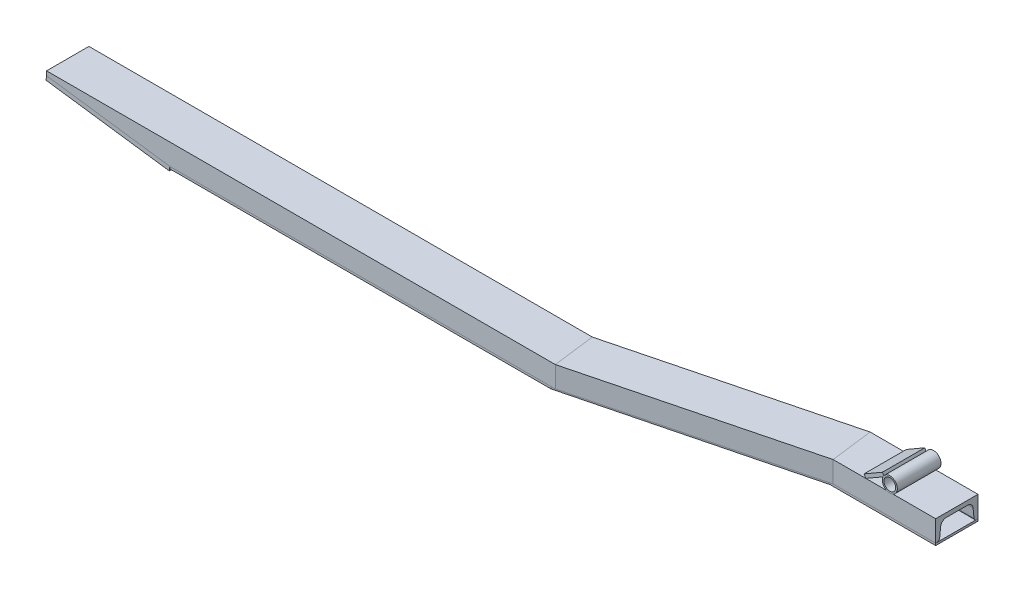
ISO-10303-21;
HEADER;
FILE_DESCRIPTION(('STEP AP214'),'2;1');
FILE_NAME('part.step','',(''),(''),'','','');
FILE_SCHEMA(('AUTOMOTIVE_DESIGN { 1 0 10303 214 1 1 1 1 }'));
ENDSEC;
DATA;
#1=APPLICATION_CONTEXT('core data for automotive mechanical design processes');
#2=APPLICATION_PROTOCOL_DEFINITION('international standard','automotive_design',2000,#1);
#3=PRODUCT_CONTEXT('',#1,'mechanical');
#4=PRODUCT('Part','Part','',(#3));
#5=PRODUCT_RELATED_PRODUCT_CATEGORY('part','',(#4));
#6=PRODUCT_DEFINITION_FORMATION('','',#4);
#7=PRODUCT_DEFINITION_CONTEXT('part definition',#1,'design');
#8=PRODUCT_DEFINITION('design','',#6,#7);
#9=PRODUCT_DEFINITION_SHAPE('','',#8);
#10=(LENGTH_UNIT() NAMED_UNIT(*) SI_UNIT(.MILLI.,.METRE.));
#11=(NAMED_UNIT(*) PLANE_ANGLE_UNIT() SI_UNIT($,.RADIAN.));
#12=(NAMED_UNIT(*) SI_UNIT($,.STERADIAN.) SOLID_ANGLE_UNIT());
#13=UNCERTAINTY_MEASURE_WITH_UNIT(LENGTH_MEASURE(1.E-05),#10,'distance_accuracy_value','');
#14=(GEOMETRIC_REPRESENTATION_CONTEXT(3) GLOBAL_UNCERTAINTY_ASSIGNED_CONTEXT((#13)) GLOBAL_UNIT_ASSIGNED_CONTEXT((#10,
#11,#12)) REPRESENTATION_CONTEXT('',''));
#15=CARTESIAN_POINT('',(0.,0.,0.));
#16=DIRECTION('',(0.,0.,1.));
#17=DIRECTION('',(1.,0.,0.));
#18=AXIS2_PLACEMENT_3D('',#15,#16,#17);
#19=CARTESIAN_POINT('',(-101.5,37.3301270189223,60.));
#20=DIRECTION('',(0.86602540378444,0.499999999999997,0.));
#21=DIRECTION('',(-0.499999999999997,0.86602540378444,0.));
#22=AXIS2_PLACEMENT_3D('',#19,#20,#21);
#23=PLANE('',#22);
#24=DIRECTION('',(0.499999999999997,-0.86602540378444,0.));
#25=VECTOR('',#24,1.);
#26=CARTESIAN_POINT('',(-101.5,37.3301270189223,0.));
#27=LINE('',#26,#25);
#28=CARTESIAN_POINT('',(-101.5,37.3301270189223,0.));
#29=VERTEX_POINT('',#28);
#30=CARTESIAN_POINT('',(-99.0000000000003,33.0000000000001,0.));
#31=VERTEX_POINT('',#30);
#32=EDGE_CURVE('E107',#29,#31,#27,.T.);
#33=ORIENTED_EDGE('',*,*,#32,.T.);
#34=DIRECTION('',(0.,0.,-1.));
#35=VECTOR('',#34,1.);
#36=CARTESIAN_POINT('',(-99.0000000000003,33.0000000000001,60.));
#37=LINE('',#36,#35);
#38=CARTESIAN_POINT('',(-99.0000000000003,33.0000000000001,60.));
#39=VERTEX_POINT('',#38);
#40=EDGE_CURVE('E12',#39,#31,#37,.T.);
#41=ORIENTED_EDGE('',*,*,#40,.F.);
#42=DIRECTION('',(0.499999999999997,-0.86602540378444,0.));
#43=VECTOR('',#42,1.);
#44=CARTESIAN_POINT('',(-101.5,37.3301270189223,60.));
#45=LINE('',#44,#43);
#46=CARTESIAN_POINT('',(-101.5,37.3301270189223,60.));
#47=VERTEX_POINT('',#46);
#48=EDGE_CURVE('E95',#47,#39,#45,.T.);
#49=ORIENTED_EDGE('',*,*,#48,.F.);
#50=DIRECTION('',(0.,0.,-1.));
#51=VECTOR('',#50,1.);
#52=CARTESIAN_POINT('',(-101.5,37.3301270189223,60.));
#53=LINE('',#52,#51);
#54=EDGE_CURVE('E103',#47,#29,#53,.T.);
#55=ORIENTED_EDGE('',*,*,#54,.T.);
#56=EDGE_LOOP('',(#33,#41,#49,#55));
#57=FACE_BOUND('',#56,.T.);
#58=ADVANCED_FACE('F44',(#57),#23,.F.);
#59=CARTESIAN_POINT('',(-99.0000000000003,33.0000000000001,60.));
#60=DIRECTION('',(-0.499999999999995,0.866025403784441,0.));
#61=DIRECTION('',(-0.866025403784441,-0.499999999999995,0.));
#62=AXIS2_PLACEMENT_3D('',#59,#60,#61);
#63=PLANE('',#62);
#64=DIRECTION('',(0.866025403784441,0.499999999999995,0.));
#65=VECTOR('',#64,1.);
#66=CARTESIAN_POINT('',(-99.0000000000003,33.0000000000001,0.));
#67=LINE('',#66,#65);
#68=CARTESIAN_POINT('',(-73.0192378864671,47.9999999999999,0.));
#69=VERTEX_POINT('',#68);
#70=EDGE_CURVE('E99',#31,#69,#67,.T.);
#71=ORIENTED_EDGE('',*,*,#70,.T.);
#72=DIRECTION('',(0.,0.,-1.));
#73=VECTOR('',#72,1.);
#74=CARTESIAN_POINT('',(-73.0192378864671,47.9999999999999,60.));
#75=LINE('',#74,#73);
#76=CARTESIAN_POINT('',(-73.0192378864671,47.9999999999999,60.));
#77=VERTEX_POINT('',#76);
#78=EDGE_CURVE('E52',#77,#69,#75,.T.);
#79=ORIENTED_EDGE('',*,*,#78,.F.);
#80=DIRECTION('',(0.866025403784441,0.499999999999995,0.));
#81=VECTOR('',#80,1.);
#82=CARTESIAN_POINT('',(-99.0000000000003,33.0000000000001,60.));
#83=LINE('',#82,#81);
#84=EDGE_CURVE('E90',#39,#77,#83,.T.);
#85=ORIENTED_EDGE('',*,*,#84,.F.);
#86=ORIENTED_EDGE('',*,*,#40,.T.);
#87=EDGE_LOOP('',(#71,#79,#85,#86));
#88=FACE_BOUND('',#87,.T.);
#89=ADVANCED_FACE('F98',(#88),#63,.F.);
#90=CARTESIAN_POINT('',(-75.5192378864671,52.3301270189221,60.));
#91=DIRECTION('',(-0.866025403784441,-0.499999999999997,0.));
#92=DIRECTION('',(0.499999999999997,-0.866025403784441,0.));
#93=AXIS2_PLACEMENT_3D('',#90,#91,#92);
#94=PLANE('',#93);
#95=DIRECTION('',(-0.499999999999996,0.866025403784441,0.));
#96=VECTOR('',#95,1.);
#97=CARTESIAN_POINT('',(-75.5192378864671,52.3301270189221,0.));
#98=LINE('',#97,#96);
#99=CARTESIAN_POINT('',(-75.5192378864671,52.3301270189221,0.));
#100=VERTEX_POINT('',#99);
#101=EDGE_CURVE('E77',#69,#100,#98,.T.);
#102=ORIENTED_EDGE('',*,*,#101,.T.);
#103=DIRECTION('',(0.,0.,-1.));
#104=VECTOR('',#103,1.);
#105=CARTESIAN_POINT('',(-75.5192378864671,52.3301270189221,60.));
#106=LINE('',#105,#104);
#107=CARTESIAN_POINT('',(-75.5192378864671,52.3301270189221,60.));
#108=VERTEX_POINT('',#107);
#109=EDGE_CURVE('E100',#108,#100,#106,.T.);
#110=ORIENTED_EDGE('',*,*,#109,.F.);
#111=DIRECTION('',(-0.499999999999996,0.866025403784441,0.));
#112=VECTOR('',#111,1.);
#113=CARTESIAN_POINT('',(-75.5192378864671,52.3301270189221,60.));
#114=LINE('',#113,#112);
#115=EDGE_CURVE('E93',#77,#108,#114,.T.);
#116=ORIENTED_EDGE('',*,*,#115,.F.);
#117=ORIENTED_EDGE('',*,*,#78,.T.);
#118=EDGE_LOOP('',(#102,#110,#116,#117));
#119=FACE_BOUND('',#118,.T.);
#120=ADVANCED_FACE('F101',(#119),#94,.F.);
#121=CARTESIAN_POINT('',(-101.5,37.3301270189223,60.));
#122=DIRECTION('',(0.499999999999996,-0.866025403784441,0.));
#123=DIRECTION('',(0.866025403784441,0.499999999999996,0.));
#124=AXIS2_PLACEMENT_3D('',#121,#122,#123);
#125=PLANE('',#124);
#126=DIRECTION('',(-0.866025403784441,-0.499999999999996,0.));
#127=VECTOR('',#126,1.);
#128=CARTESIAN_POINT('',(-101.5,37.3301270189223,0.));
#129=LINE('',#128,#127);
#130=EDGE_CURVE('E83',#100,#29,#129,.T.);
#131=ORIENTED_EDGE('',*,*,#130,.T.);
#132=ORIENTED_EDGE('',*,*,#54,.F.);
#133=DIRECTION('',(-0.866025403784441,-0.499999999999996,0.));
#134=VECTOR('',#133,1.);
#135=CARTESIAN_POINT('',(-101.5,37.3301270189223,60.));
#136=LINE('',#135,#134);
#137=EDGE_CURVE('E60',#108,#47,#136,.T.);
#138=ORIENTED_EDGE('',*,*,#137,.F.);
#139=ORIENTED_EDGE('',*,*,#109,.T.);
#140=EDGE_LOOP('',(#131,#132,#138,#139));
#141=FACE_BOUND('',#140,.T.);
#142=ADVANCED_FACE('F114',(#141),#125,.F.);
#143=CARTESIAN_POINT('',(-101.5,37.3301270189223,60.));
#144=DIRECTION('',(0.,0.,1.));
#145=DIRECTION('',(1.,0.,0.));
#146=AXIS2_PLACEMENT_3D('',#143,#144,#145);
#147=PLANE('',#146);
#148=ORIENTED_EDGE('',*,*,#48,.T.);
#149=ORIENTED_EDGE('',*,*,#84,.T.);
#150=ORIENTED_EDGE('',*,*,#115,.T.);
#151=ORIENTED_EDGE('',*,*,#137,.T.);
#152=EDGE_LOOP('',(#148,#149,#150,#151));
#153=FACE_BOUND('',#152,.T.);
#154=ADVANCED_FACE('F91',(#153),#147,.T.);
#155=CARTESIAN_POINT('',(-101.5,37.3301270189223,0.));
#156=DIRECTION('',(0.,0.,1.));
#157=DIRECTION('',(1.,0.,0.));
#158=AXIS2_PLACEMENT_3D('',#155,#156,#157);
#159=PLANE('',#158);
#160=ORIENTED_EDGE('',*,*,#32,.F.);
#161=ORIENTED_EDGE('',*,*,#130,.F.);
#162=ORIENTED_EDGE('',*,*,#101,.F.);
#163=ORIENTED_EDGE('',*,*,#70,.F.);
#164=EDGE_LOOP('',(#160,#161,#162,#163));
#165=FACE_BOUND('',#164,.T.);
#166=ADVANCED_FACE('F117',(#165),#159,.F.);
#167=CLOSED_SHELL('',(#58,#89,#120,#142,#154,#166));
#168=MANIFOLD_SOLID_BREP('B2',#167);
#169=CARTESIAN_POINT('',(-64.,43.65,61.));
#170=DIRECTION('',(0.,0.,-1.));
#171=DIRECTION('',(-1.,0.,0.));
#172=AXIS2_PLACEMENT_3D('',#169,#170,#171);
#173=CYLINDRICAL_SURFACE('',#172,8.35);
#174=CARTESIAN_POINT('',(-64.,43.65,61.));
#175=DIRECTION('',(0.,0.,1.));
#176=DIRECTION('',(1.,0.,0.));
#177=AXIS2_PLACEMENT_3D('',#174,#175,#176);
#178=CIRCLE('',#177,8.35);
#179=CARTESIAN_POINT('',(-55.65,43.65,61.));
#180=VERTEX_POINT('',#179);
#181=EDGE_CURVE('E197',#180,#180,#178,.T.);
#182=ORIENTED_EDGE('',*,*,#181,.T.);
#183=EDGE_LOOP('',(#182));
#184=FACE_BOUND('',#183,.T.);
#185=CARTESIAN_POINT('',(-64.,43.65,-0.999999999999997));
#186=DIRECTION('',(0.,0.,1.));
#187=DIRECTION('',(1.,0.,0.));
#188=AXIS2_PLACEMENT_3D('',#185,#186,#187);
#189=CIRCLE('',#188,8.35);
#190=CARTESIAN_POINT('',(-55.65,43.65,-0.999999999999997));
#191=VERTEX_POINT('',#190);
#192=EDGE_CURVE('E203',#191,#191,#189,.T.);
#193=ORIENTED_EDGE('',*,*,#192,.F.);
#194=EDGE_LOOP('',(#193));
#195=FACE_BOUND('',#194,.T.);
#196=ADVANCED_FACE('F190',(#184,#195),#173,.F.);
#197=CARTESIAN_POINT('',(-64.,43.65,61.));
#198=DIRECTION('',(0.,0.,-1.));
#199=DIRECTION('',(-1.,0.,0.));
#200=AXIS2_PLACEMENT_3D('',#197,#198,#199);
#201=CYLINDRICAL_SURFACE('',#200,10.65);
#202=CARTESIAN_POINT('',(-64.,43.65,61.));
#203=DIRECTION('',(0.,0.,1.));
#204=DIRECTION('',(1.,0.,0.));
#205=AXIS2_PLACEMENT_3D('',#202,#203,#204);
#206=CIRCLE('',#205,10.65);
#207=CARTESIAN_POINT('',(-53.35,43.65,61.));
#208=VERTEX_POINT('',#207);
#209=EDGE_CURVE('E43',#208,#208,#206,.T.);
#210=ORIENTED_EDGE('',*,*,#209,.F.);
#211=EDGE_LOOP('',(#210));
#212=FACE_BOUND('',#211,.T.);
#213=CARTESIAN_POINT('',(-64.,43.65,-0.999999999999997));
#214=DIRECTION('',(0.,0.,1.));
#215=DIRECTION('',(1.,0.,0.));
#216=AXIS2_PLACEMENT_3D('',#213,#214,#215);
#217=CIRCLE('',#216,10.65);
#218=CARTESIAN_POINT('',(-53.35,43.65,-0.999999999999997));
#219=VERTEX_POINT('',#218);
#220=EDGE_CURVE('E193',#219,#219,#217,.T.);
#221=ORIENTED_EDGE('',*,*,#220,.T.);
#222=EDGE_LOOP('',(#221));
#223=FACE_BOUND('',#222,.T.);
#224=ADVANCED_FACE('F210',(#212,#223),#201,.T.);
#225=CARTESIAN_POINT('',(-64.,43.65,61.));
#226=DIRECTION('',(0.,0.,1.));
#227=DIRECTION('',(1.,0.,0.));
#228=AXIS2_PLACEMENT_3D('',#225,#226,#227);
#229=PLANE('',#228);
#230=ORIENTED_EDGE('',*,*,#181,.F.);
#231=EDGE_LOOP('',(#230));
#232=FACE_BOUND('',#231,.T.);
#233=ORIENTED_EDGE('',*,*,#209,.T.);
#234=EDGE_LOOP('',(#233));
#235=FACE_BOUND('',#234,.T.);
#236=ADVANCED_FACE('F214',(#232,#235),#229,.T.);
#237=CARTESIAN_POINT('',(-64.,43.65,-0.999999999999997));
#238=DIRECTION('',(0.,0.,1.));
#239=DIRECTION('',(1.,0.,0.));
#240=AXIS2_PLACEMENT_3D('',#237,#238,#239);
#241=PLANE('',#240);
#242=ORIENTED_EDGE('',*,*,#192,.T.);
#243=EDGE_LOOP('',(#242));
#244=FACE_BOUND('',#243,.T.);
#245=ORIENTED_EDGE('',*,*,#220,.F.);
#246=EDGE_LOOP('',(#245));
#247=FACE_BOUND('',#246,.T.);
#248=ADVANCED_FACE('F212',(#244,#247),#241,.F.);
#249=CLOSED_SHELL('',(#196,#224,#236,#248));
#250=MANIFOLD_SOLID_BREP('B6',#249);
#251=CARTESIAN_POINT('',(-1005.2,3.00000000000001,140.3));
#252=DIRECTION('',(0.,0.,-1.));
#253=DIRECTION('',(-1.,0.,0.));
#254=AXIS2_PLACEMENT_3D('',#251,#252,#253);
#255=PLANE('',#254);
#256=DIRECTION('',(-0.136023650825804,-0.990705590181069,0.));
#257=VECTOR('',#256,1.);
#258=CARTESIAN_POINT('',(-1180.,27.,140.3));
#259=LINE('',#258,#257);
#260=CARTESIAN_POINT('',(-1180.,27.,140.3));
#261=VERTEX_POINT('',#260);
#262=CARTESIAN_POINT('',(-1180.81614190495,21.0557664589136,140.3));
#263=VERTEX_POINT('',#262);
#264=EDGE_CURVE('E333',#261,#263,#259,.T.);
#265=ORIENTED_EDGE('',*,*,#264,.T.);
#266=DIRECTION('',(-0.990705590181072,0.136023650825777,0.));
#267=VECTOR('',#266,1.);
#268=CARTESIAN_POINT('',(-1006.01614190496,-2.94423354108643,140.3));
#269=LINE('',#268,#267);
#270=CARTESIAN_POINT('',(-1006.01614190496,-2.94423354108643,140.3));
#271=VERTEX_POINT('',#270);
#272=EDGE_CURVE('E188',#271,#263,#269,.T.);
#273=ORIENTED_EDGE('',*,*,#272,.F.);
#274=DIRECTION('',(-0.136023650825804,-0.990705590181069,0.));
#275=VECTOR('',#274,1.);
#276=CARTESIAN_POINT('',(-1005.2,3.00000000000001,140.3));
#277=LINE('',#276,#275);
#278=CARTESIAN_POINT('',(-1005.2,3.00000000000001,140.3));
#279=VERTEX_POINT('',#278);
#280=EDGE_CURVE('E321',#279,#271,#277,.T.);
#281=ORIENTED_EDGE('',*,*,#280,.F.);
#282=DIRECTION('',(-0.990705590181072,0.136023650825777,0.));
#283=VECTOR('',#282,1.);
#284=CARTESIAN_POINT('',(-1005.2,3.00000000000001,140.3));
#285=LINE('',#284,#283);
#286=EDGE_CURVE('E329',#279,#261,#285,.T.);
#287=ORIENTED_EDGE('',*,*,#286,.T.);
#288=EDGE_LOOP('',(#265,#273,#281,#287));
#289=FACE_BOUND('',#288,.T.);
#290=ADVANCED_FACE('F270',(#289),#255,.F.);
#291=CARTESIAN_POINT('',(-1006.01614190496,-2.94423354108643,140.3));
#292=DIRECTION('',(0.136023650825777,0.990705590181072,0.));
#293=DIRECTION('',(-0.990705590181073,0.136023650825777,0.));
#294=AXIS2_PLACEMENT_3D('',#291,#292,#293);
#295=PLANE('',#294);
#296=DIRECTION('',(0.,0.,-1.));
#297=VECTOR('',#296,1.);
#298=CARTESIAN_POINT('',(-1180.81614190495,21.0557664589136,140.3));
#299=LINE('',#298,#297);
#300=CARTESIAN_POINT('',(-1180.81614190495,21.0557664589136,80.3000000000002));
#301=VERTEX_POINT('',#300);
#302=EDGE_CURVE('E325',#263,#301,#299,.T.);
#303=ORIENTED_EDGE('',*,*,#302,.T.);
#304=DIRECTION('',(-0.990705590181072,0.136023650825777,0.));
#305=VECTOR('',#304,1.);
#306=CARTESIAN_POINT('',(-1006.01614190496,-2.94423354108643,80.3000000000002));
#307=LINE('',#306,#305);
#308=CARTESIAN_POINT('',(-1006.01614190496,-2.94423354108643,80.3000000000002));
#309=VERTEX_POINT('',#308);
#310=EDGE_CURVE('E278',#309,#301,#307,.T.);
#311=ORIENTED_EDGE('',*,*,#310,.F.);
#312=DIRECTION('',(0.,0.,-1.));
#313=VECTOR('',#312,1.);
#314=CARTESIAN_POINT('',(-1006.01614190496,-2.94423354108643,140.3));
#315=LINE('',#314,#313);
#316=EDGE_CURVE('E316',#271,#309,#315,.T.);
#317=ORIENTED_EDGE('',*,*,#316,.F.);
#318=ORIENTED_EDGE('',*,*,#272,.T.);
#319=EDGE_LOOP('',(#303,#311,#317,#318));
#320=FACE_BOUND('',#319,.T.);
#321=ADVANCED_FACE('F324',(#320),#295,.F.);
#322=CARTESIAN_POINT('',(-1005.2,3.00000000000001,80.3000000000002));
#323=DIRECTION('',(0.,0.,1.));
#324=DIRECTION('',(1.,0.,0.));
#325=AXIS2_PLACEMENT_3D('',#322,#323,#324);
#326=PLANE('',#325);
#327=DIRECTION('',(0.136023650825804,0.990705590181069,0.));
#328=VECTOR('',#327,1.);
#329=CARTESIAN_POINT('',(-1180.,27.,80.3000000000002));
#330=LINE('',#329,#328);
#331=CARTESIAN_POINT('',(-1180.,27.,80.3000000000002));
#332=VERTEX_POINT('',#331);
#333=EDGE_CURVE('E303',#301,#332,#330,.T.);
#334=ORIENTED_EDGE('',*,*,#333,.T.);
#335=DIRECTION('',(-0.990705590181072,0.136023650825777,0.));
#336=VECTOR('',#335,1.);
#337=CARTESIAN_POINT('',(-1005.2,3.00000000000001,80.3000000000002));
#338=LINE('',#337,#336);
#339=CARTESIAN_POINT('',(-1005.2,3.00000000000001,80.3000000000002));
#340=VERTEX_POINT('',#339);
#341=EDGE_CURVE('E326',#340,#332,#338,.T.);
#342=ORIENTED_EDGE('',*,*,#341,.F.);
#343=DIRECTION('',(0.136023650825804,0.990705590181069,0.));
#344=VECTOR('',#343,1.);
#345=CARTESIAN_POINT('',(-1005.2,3.00000000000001,80.3000000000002));
#346=LINE('',#345,#344);
#347=EDGE_CURVE('E319',#309,#340,#346,.T.);
#348=ORIENTED_EDGE('',*,*,#347,.F.);
#349=ORIENTED_EDGE('',*,*,#310,.T.);
#350=EDGE_LOOP('',(#334,#342,#348,#349));
#351=FACE_BOUND('',#350,.T.);
#352=ADVANCED_FACE('F327',(#351),#326,.F.);
#353=CARTESIAN_POINT('',(-1005.2,3.00000000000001,140.3));
#354=DIRECTION('',(-0.136023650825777,-0.990705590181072,0.));
#355=DIRECTION('',(0.990705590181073,-0.136023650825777,0.));
#356=AXIS2_PLACEMENT_3D('',#353,#354,#355);
#357=PLANE('',#356);
#358=DIRECTION('',(0.,0.,1.));
#359=VECTOR('',#358,1.);
#360=CARTESIAN_POINT('',(-1180.,27.,140.3));
#361=LINE('',#360,#359);
#362=EDGE_CURVE('E309',#332,#261,#361,.T.);
#363=ORIENTED_EDGE('',*,*,#362,.T.);
#364=ORIENTED_EDGE('',*,*,#286,.F.);
#365=DIRECTION('',(0.,0.,1.));
#366=VECTOR('',#365,1.);
#367=CARTESIAN_POINT('',(-1005.2,3.00000000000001,140.3));
#368=LINE('',#367,#366);
#369=EDGE_CURVE('E286',#340,#279,#368,.T.);
#370=ORIENTED_EDGE('',*,*,#369,.F.);
#371=ORIENTED_EDGE('',*,*,#341,.T.);
#372=EDGE_LOOP('',(#363,#364,#370,#371));
#373=FACE_BOUND('',#372,.T.);
#374=ADVANCED_FACE('F340',(#373),#357,.F.);
#375=CARTESIAN_POINT('',(-1006.01614190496,-2.94423354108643,140.3));
#376=DIRECTION('',(0.990705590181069,-0.136023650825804,0.));
#377=DIRECTION('',(0.136023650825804,0.990705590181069,0.));
#378=AXIS2_PLACEMENT_3D('',#375,#376,#377);
#379=PLANE('',#378);
#380=ORIENTED_EDGE('',*,*,#280,.T.);
#381=ORIENTED_EDGE('',*,*,#316,.T.);
#382=ORIENTED_EDGE('',*,*,#347,.T.);
#383=ORIENTED_EDGE('',*,*,#369,.T.);
#384=EDGE_LOOP('',(#380,#381,#382,#383));
#385=FACE_BOUND('',#384,.T.);
#386=ADVANCED_FACE('F317',(#385),#379,.T.);
#387=CARTESIAN_POINT('',(-1180.81614190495,21.0557664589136,140.3));
#388=DIRECTION('',(0.990705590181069,-0.136023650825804,0.));
#389=DIRECTION('',(0.136023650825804,0.990705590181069,0.));
#390=AXIS2_PLACEMENT_3D('',#387,#388,#389);
#391=PLANE('',#390);
#392=ORIENTED_EDGE('',*,*,#264,.F.);
#393=ORIENTED_EDGE('',*,*,#362,.F.);
#394=ORIENTED_EDGE('',*,*,#333,.F.);
#395=ORIENTED_EDGE('',*,*,#302,.F.);
#396=EDGE_LOOP('',(#392,#393,#394,#395));
#397=FACE_BOUND('',#396,.T.);
#398=ADVANCED_FACE('F343',(#397),#391,.F.);
#399=CLOSED_SHELL('',(#290,#321,#352,#374,#386,#398));
#400=MANIFOLD_SOLID_BREP('B38',#399);
#401=CARTESIAN_POINT('',(-453.259983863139,19.8362277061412,131.600063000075));
#402=DIRECTION('',(0.246770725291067,0.104528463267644,0.963419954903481));
#403=DIRECTION('',(0.968726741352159,0.,-0.248130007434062));
#404=AXIS2_PLACEMENT_3D('',#401,#402,#403);
#405=PLANE('',#404);
#406=DIRECTION('',(0.0131731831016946,-0.994435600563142,0.104519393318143));
#407=VECTOR('',#406,1.);
#408=CARTESIAN_POINT('',(-459.726785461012,19.9236612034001,133.24698553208));
#409=LINE('',#408,#407);
#410=CARTESIAN_POINT('',(-459.725627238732,19.8362277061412,133.256175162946));
#411=VERTEX_POINT('',#410);
#412=CARTESIAN_POINT('',(-459.550048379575,6.58188614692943,134.649262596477));
#413=VERTEX_POINT('',#412);
#414=EDGE_CURVE('E505',#411,#413,#409,.T.);
#415=ORIENTED_EDGE('',*,*,#414,.F.);
#416=DIRECTION('',(0.968726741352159,0.,-0.248130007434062));
#417=VECTOR('',#416,1.);
#418=CARTESIAN_POINT('',(-453.259983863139,19.8362277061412,131.600063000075));
#419=LINE('',#418,#417);
#420=CARTESIAN_POINT('',(-146.225627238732,19.8362277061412,52.9561751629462));
#421=VERTEX_POINT('',#420);
#422=EDGE_CURVE('E573',#411,#421,#419,.T.);
#423=ORIENTED_EDGE('',*,*,#422,.T.);
#424=DIRECTION('',(0.0131731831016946,-0.994435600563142,0.104519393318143));
#425=VECTOR('',#424,1.);
#426=CARTESIAN_POINT('',(-146.170626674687,15.6842684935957,53.392563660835));
#427=LINE('',#426,#425);
#428=CARTESIAN_POINT('',(-146.050048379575,6.58188614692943,54.3492625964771));
#429=VERTEX_POINT('',#428);
#430=EDGE_CURVE('E508',#421,#429,#427,.T.);
#431=ORIENTED_EDGE('',*,*,#430,.T.);
#432=DIRECTION('',(0.968726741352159,0.,-0.248130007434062));
#433=VECTOR('',#432,1.);
#434=CARTESIAN_POINT('',(-452.914317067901,6.58188614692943,132.949584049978));
#435=LINE('',#434,#433);
#436=EDGE_CURVE('E420',#413,#429,#435,.T.);
#437=ORIENTED_EDGE('',*,*,#436,.F.);
#438=EDGE_LOOP('',(#415,#423,#431,#437));
#439=FACE_BOUND('',#438,.T.);
#440=ADVANCED_FACE('F416',(#439),#405,.F.);
#441=CARTESIAN_POINT('',(-455.234149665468,19.,123.892703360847));
#442=DIRECTION('',(0.968726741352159,0.,-0.248130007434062));
#443=DIRECTION('',(-0.248130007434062,0.,-0.968726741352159));
#444=AXIS2_PLACEMENT_3D('',#441,#442,#443);
#445=CYLINDRICAL_SURFACE('',#444,8.);
#446=CARTESIAN_POINT('',(-460.72838996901,19.,125.3));
#447=DIRECTION('',(-0.992150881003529,0.,0.125046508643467));
#448=DIRECTION('',(-0.125046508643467,0.,-0.992150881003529));
#449=AXIS2_PLACEMENT_3D('',#446,#447,#448);
#450=ELLIPSE('',#449,8.06328972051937,8.);
#451=CARTESIAN_POINT('',(-460.72838996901,27.,125.3));
#452=VERTEX_POINT('',#451);
#453=EDGE_CURVE('E519',#452,#411,#450,.F.);
#454=ORIENTED_EDGE('',*,*,#453,.F.);
#455=DIRECTION('',(0.968726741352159,0.,-0.248130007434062));
#456=VECTOR('',#455,1.);
#457=CARTESIAN_POINT('',(-455.234149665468,27.,123.892703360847));
#458=LINE('',#457,#456);
#459=CARTESIAN_POINT('',(-147.228389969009,27.,45.));
#460=VERTEX_POINT('',#459);
#461=EDGE_CURVE('E572',#452,#460,#458,.T.);
#462=ORIENTED_EDGE('',*,*,#461,.T.);
#463=CARTESIAN_POINT('',(-147.228389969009,19.,45.));
#464=DIRECTION('',(-0.992150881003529,0.,0.125046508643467));
#465=DIRECTION('',(-0.125046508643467,0.,-0.992150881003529));
#466=AXIS2_PLACEMENT_3D('',#463,#464,#465);
#467=ELLIPSE('',#466,8.06328972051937,8.);
#468=EDGE_CURVE('E523',#460,#421,#467,.F.);
#469=ORIENTED_EDGE('',*,*,#468,.T.);
#470=ORIENTED_EDGE('',*,*,#422,.F.);
#471=EDGE_LOOP('',(#454,#462,#469,#470));
#472=FACE_BOUND('',#471,.T.);
#473=ADVANCED_FACE('F634',(#472),#445,.F.);
#474=CARTESIAN_POINT('',(-455.234149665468,27.,123.892703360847));
#475=DIRECTION('',(0.,1.,0.));
#476=DIRECTION('',(0.,0.,1.));
#477=AXIS2_PLACEMENT_3D('',#474,#475,#476);
#478=PLANE('',#477);
#479=DIRECTION('',(0.125046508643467,0.,0.992150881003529));
#480=VECTOR('',#479,1.);
#481=CARTESIAN_POINT('',(-460.817074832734,27.,124.596351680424));
#482=LINE('',#481,#480);
#483=CARTESIAN_POINT('',(-464.509463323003,27.,95.3000000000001));
#484=VERTEX_POINT('',#483);
#485=EDGE_CURVE('E268',#484,#452,#482,.T.);
#486=ORIENTED_EDGE('',*,*,#485,.F.);
#487=DIRECTION('',(0.968726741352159,0.,-0.248130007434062));
#488=VECTOR('',#487,1.);
#489=CARTESIAN_POINT('',(-462.678049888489,27.,94.8309011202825));
#490=LINE('',#489,#488);
#491=CARTESIAN_POINT('',(-151.009463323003,27.,15.));
#492=VERTEX_POINT('',#491);
#493=EDGE_CURVE('E570',#484,#492,#490,.T.);
#494=ORIENTED_EDGE('',*,*,#493,.T.);
#495=DIRECTION('',(0.125046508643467,0.,0.992150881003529));
#496=VECTOR('',#495,1.);
#497=CARTESIAN_POINT('',(-142.256738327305,27.,84.4463516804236));
#498=LINE('',#497,#496);
#499=EDGE_CURVE('E569',#492,#460,#498,.T.);
#500=ORIENTED_EDGE('',*,*,#499,.T.);
#501=ORIENTED_EDGE('',*,*,#461,.F.);
#502=EDGE_LOOP('',(#486,#494,#500,#501));
#503=FACE_BOUND('',#502,.T.);
#504=ADVANCED_FACE('F596',(#503),#478,.F.);
#505=CARTESIAN_POINT('',(-462.678049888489,19.,94.8309011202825));
#506=DIRECTION('',(0.968726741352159,0.,-0.248130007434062));
#507=DIRECTION('',(-0.248130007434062,0.,-0.968726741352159));
#508=AXIS2_PLACEMENT_3D('',#505,#506,#507);
#509=CYLINDRICAL_SURFACE('',#508,8.);
#510=CARTESIAN_POINT('',(-464.509463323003,19.,95.3000000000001));
#511=DIRECTION('',(-0.992150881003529,0.,0.125046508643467));
#512=DIRECTION('',(-0.125046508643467,0.,-0.992150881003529));
#513=AXIS2_PLACEMENT_3D('',#510,#511,#512);
#514=ELLIPSE('',#513,8.06328972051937,8.);
#515=CARTESIAN_POINT('',(-465.512226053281,19.8362277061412,87.3438248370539));
#516=VERTEX_POINT('',#515);
#517=EDGE_CURVE('E425',#516,#484,#514,.F.);
#518=ORIENTED_EDGE('',*,*,#517,.F.);
#519=DIRECTION('',(0.968726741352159,0.,-0.248130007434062));
#520=VECTOR('',#519,1.);
#521=CARTESIAN_POINT('',(-464.652215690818,19.8362277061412,87.1235414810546));
#522=LINE('',#521,#520);
#523=CARTESIAN_POINT('',(-152.012226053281,19.8362277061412,7.04382483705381));
#524=VERTEX_POINT('',#523);
#525=EDGE_CURVE('E567',#516,#524,#522,.T.);
#526=ORIENTED_EDGE('',*,*,#525,.T.);
#527=CARTESIAN_POINT('',(-151.009463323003,19.,15.));
#528=DIRECTION('',(-0.992150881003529,0.,0.125046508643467));
#529=DIRECTION('',(-0.125046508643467,0.,-0.992150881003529));
#530=AXIS2_PLACEMENT_3D('',#527,#528,#529);
#531=ELLIPSE('',#530,8.06328972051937,8.);
#532=EDGE_CURVE('E566',#524,#492,#531,.F.);
#533=ORIENTED_EDGE('',*,*,#532,.T.);
#534=ORIENTED_EDGE('',*,*,#493,.F.);
#535=EDGE_LOOP('',(#518,#526,#533,#534));
#536=FACE_BOUND('',#535,.T.);
#537=ADVANCED_FACE('F605',(#536),#509,.F.);
#538=CARTESIAN_POINT('',(-464.652215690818,19.8362277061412,87.1235414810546));
#539=DIRECTION('',(-0.246770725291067,0.104528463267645,-0.963419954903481));
#540=DIRECTION('',(-0.968726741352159,0.,0.248130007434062));
#541=AXIS2_PLACEMENT_3D('',#538,#539,#540);
#542=PLANE('',#541);
#543=DIRECTION('',(0.0131731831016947,0.994435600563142,0.104519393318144));
#544=VECTOR('',#543,1.);
#545=CARTESIAN_POINT('',(-465.512380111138,19.8245979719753,87.3426025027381));
#546=LINE('',#545,#544);
#547=CARTESIAN_POINT('',(-465.687804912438,6.58188614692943,85.950737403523));
#548=VERTEX_POINT('',#547);
#549=EDGE_CURVE('E528',#548,#516,#546,.T.);
#550=ORIENTED_EDGE('',*,*,#549,.F.);
#551=DIRECTION('',(0.968726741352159,0.,-0.248130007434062));
#552=VECTOR('',#551,1.);
#553=CARTESIAN_POINT('',(-464.997882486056,6.58188614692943,85.7740204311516));
#554=LINE('',#553,#552);
#555=CARTESIAN_POINT('',(-152.187804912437,6.58188614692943,5.65073740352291));
#556=VERTEX_POINT('',#555);
#557=EDGE_CURVE('E564',#548,#556,#554,.T.);
#558=ORIENTED_EDGE('',*,*,#557,.T.);
#559=DIRECTION('',(0.0131731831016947,0.994435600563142,0.104519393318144));
#560=VECTOR('',#559,1.);
#561=CARTESIAN_POINT('',(-151.956221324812,24.0639906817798,7.48818063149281));
#562=LINE('',#561,#560);
#563=EDGE_CURVE('E563',#556,#524,#562,.T.);
#564=ORIENTED_EDGE('',*,*,#563,.T.);
#565=ORIENTED_EDGE('',*,*,#525,.F.);
#566=EDGE_LOOP('',(#550,#558,#564,#565));
#567=FACE_BOUND('',#566,.T.);
#568=ADVANCED_FACE('F608',(#567),#542,.F.);
#569=CARTESIAN_POINT('',(-465.984965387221,7.,81.9203406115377));
#570=DIRECTION('',(0.968726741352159,0.,-0.248130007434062));
#571=DIRECTION('',(-0.248130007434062,0.,-0.968726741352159));
#572=AXIS2_PLACEMENT_3D('',#569,#570,#571);
#573=CYLINDRICAL_SURFACE('',#572,4.);
#574=CARTESIAN_POINT('',(-466.189186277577,7.,81.9726498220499));
#575=DIRECTION('',(-0.992150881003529,0.,0.125046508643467));
#576=DIRECTION('',(-0.125046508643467,0.,-0.992150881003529));
#577=AXIS2_PLACEMENT_3D('',#574,#575,#576);
#578=ELLIPSE('',#577,4.03164486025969,4.);
#579=CARTESIAN_POINT('',(-466.189186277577,3.00000000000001,81.9726498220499));
#580=VERTEX_POINT('',#579);
#581=EDGE_CURVE('E531',#580,#548,#578,.T.);
#582=ORIENTED_EDGE('',*,*,#581,.F.);
#583=DIRECTION('',(0.968726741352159,0.,-0.248130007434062));
#584=VECTOR('',#583,1.);
#585=CARTESIAN_POINT('',(-465.984965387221,3.,81.9203406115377));
#586=LINE('',#585,#584);
#587=CARTESIAN_POINT('',(-152.689186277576,3.,1.67264982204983));
#588=VERTEX_POINT('',#587);
#589=EDGE_CURVE('E561',#580,#588,#586,.T.);
#590=ORIENTED_EDGE('',*,*,#589,.T.);
#591=CARTESIAN_POINT('',(-152.689186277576,7.,1.6726498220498));
#592=DIRECTION('',(-0.992150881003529,0.,0.125046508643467));
#593=DIRECTION('',(-0.125046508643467,0.,-0.992150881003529));
#594=AXIS2_PLACEMENT_3D('',#591,#592,#593);
#595=ELLIPSE('',#594,4.03164486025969,4.);
#596=EDGE_CURVE('E560',#588,#556,#595,.T.);
#597=ORIENTED_EDGE('',*,*,#596,.T.);
#598=ORIENTED_EDGE('',*,*,#557,.F.);
#599=EDGE_LOOP('',(#582,#590,#597,#598));
#600=FACE_BOUND('',#599,.T.);
#601=ADVANCED_FACE('F612',(#600),#573,.T.);
#602=CARTESIAN_POINT('',(-466.4,3.,80.3000000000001));
#603=DIRECTION('',(0.,1.,0.));
#604=DIRECTION('',(0.,0.,1.));
#605=AXIS2_PLACEMENT_3D('',#602,#603,#604);
#606=PLANE('',#605);
#607=DIRECTION('',(0.125046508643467,0.,0.992150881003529));
#608=VECTOR('',#607,1.);
#609=CARTESIAN_POINT('',(-466.4,3.,80.3000000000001));
#610=LINE('',#609,#608);
#611=CARTESIAN_POINT('',(-466.4,3.,80.3000000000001));
#612=VERTEX_POINT('',#611);
#613=EDGE_CURVE('E534',#612,#580,#610,.T.);
#614=ORIENTED_EDGE('',*,*,#613,.F.);
#615=DIRECTION('',(0.968726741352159,0.,-0.248130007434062));
#616=VECTOR('',#615,1.);
#617=CARTESIAN_POINT('',(-466.4,3.,80.3000000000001));
#618=LINE('',#617,#616);
#619=CARTESIAN_POINT('',(-152.9,3.,0.));
#620=VERTEX_POINT('',#619);
#621=EDGE_CURVE('E558',#612,#620,#618,.T.);
#622=ORIENTED_EDGE('',*,*,#621,.T.);
#623=DIRECTION('',(0.125046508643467,0.,0.992150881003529));
#624=VECTOR('',#623,1.);
#625=CARTESIAN_POINT('',(-147.839663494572,3.00000000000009,40.15));
#626=LINE('',#625,#624);
#627=EDGE_CURVE('E557',#620,#588,#626,.T.);
#628=ORIENTED_EDGE('',*,*,#627,.T.);
#629=ORIENTED_EDGE('',*,*,#589,.F.);
#630=EDGE_LOOP('',(#614,#622,#628,#629));
#631=FACE_BOUND('',#630,.T.);
#632=ADVANCED_FACE('F615',(#631),#606,.F.);
#633=CARTESIAN_POINT('',(-466.4,3.,80.3000000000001));
#634=DIRECTION('',(0.248130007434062,0.,0.968726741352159));
#635=DIRECTION('',(0.968726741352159,0.,-0.248130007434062));
#636=AXIS2_PLACEMENT_3D('',#633,#634,#635);
#637=PLANE('',#636);
#638=DIRECTION('',(0.,-1.,0.));
#639=VECTOR('',#638,1.);
#640=CARTESIAN_POINT('',(-466.4,3.,80.3000000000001));
#641=LINE('',#640,#639);
#642=CARTESIAN_POINT('',(-466.4,33.,80.3000000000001));
#643=VERTEX_POINT('',#642);
#644=EDGE_CURVE('E537',#643,#612,#641,.T.);
#645=ORIENTED_EDGE('',*,*,#644,.F.);
#646=DIRECTION('',(0.968726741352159,0.,-0.248130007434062));
#647=VECTOR('',#646,1.);
#648=CARTESIAN_POINT('',(-466.4,33.,80.3000000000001));
#649=LINE('',#648,#647);
#650=CARTESIAN_POINT('',(-152.9,33.,0.));
#651=VERTEX_POINT('',#650);
#652=EDGE_CURVE('E555',#643,#651,#649,.T.);
#653=ORIENTED_EDGE('',*,*,#652,.T.);
#654=DIRECTION('',(0.,-1.,0.));
#655=VECTOR('',#654,1.);
#656=CARTESIAN_POINT('',(-152.9,3.00000000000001,0.));
#657=LINE('',#656,#655);
#658=EDGE_CURVE('E554',#651,#620,#657,.T.);
#659=ORIENTED_EDGE('',*,*,#658,.T.);
#660=ORIENTED_EDGE('',*,*,#621,.F.);
#661=EDGE_LOOP('',(#645,#653,#659,#660));
#662=FACE_BOUND('',#661,.T.);
#663=ADVANCED_FACE('F621',(#662),#637,.F.);
#664=CARTESIAN_POINT('',(-451.512199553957,33.,138.42360448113));
#665=DIRECTION('',(0.,-1.,0.));
#666=DIRECTION('',(0.,0.,-1.));
#667=AXIS2_PLACEMENT_3D('',#664,#665,#666);
#668=PLANE('',#667);
#669=DIRECTION('',(-0.125046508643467,0.,-0.992150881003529));
#670=VECTOR('',#669,1.);
#671=CARTESIAN_POINT('',(-458.956099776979,33.,139.361802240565));
#672=LINE('',#671,#670);
#673=CARTESIAN_POINT('',(-458.837853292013,33.,140.3));
#674=VERTEX_POINT('',#673);
#675=EDGE_CURVE('E540',#674,#643,#672,.T.);
#676=ORIENTED_EDGE('',*,*,#675,.F.);
#677=DIRECTION('',(0.968726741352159,0.,-0.248130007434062));
#678=VECTOR('',#677,1.);
#679=CARTESIAN_POINT('',(-451.512199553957,33.,138.42360448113));
#680=LINE('',#679,#678);
#681=CARTESIAN_POINT('',(-145.337853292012,33.,60.));
#682=VERTEX_POINT('',#681);
#683=EDGE_CURVE('E552',#674,#682,#680,.T.);
#684=ORIENTED_EDGE('',*,*,#683,.T.);
#685=DIRECTION('',(-0.125046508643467,0.,-0.992150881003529));
#686=VECTOR('',#685,1.);
#687=CARTESIAN_POINT('',(-140.39576327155,33.,99.2118022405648));
#688=LINE('',#687,#686);
#689=EDGE_CURVE('E551',#682,#651,#688,.T.);
#690=ORIENTED_EDGE('',*,*,#689,.T.);
#691=ORIENTED_EDGE('',*,*,#652,.F.);
#692=EDGE_LOOP('',(#676,#684,#690,#691));
#693=FACE_BOUND('',#692,.T.);
#694=ADVANCED_FACE('F624',(#693),#668,.F.);
#695=CARTESIAN_POINT('',(-451.512199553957,3.,138.42360448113));
#696=DIRECTION('',(-0.248130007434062,0.,-0.968726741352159));
#697=DIRECTION('',(-0.968726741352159,0.,0.248130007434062));
#698=AXIS2_PLACEMENT_3D('',#695,#696,#697);
#699=PLANE('',#698);
#700=DIRECTION('',(0.,1.,0.));
#701=VECTOR('',#700,1.);
#702=CARTESIAN_POINT('',(-458.837853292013,3.,140.3));
#703=LINE('',#702,#701);
#704=CARTESIAN_POINT('',(-458.837853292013,3.,140.3));
#705=VERTEX_POINT('',#704);
#706=EDGE_CURVE('E543',#705,#674,#703,.T.);
#707=ORIENTED_EDGE('',*,*,#706,.F.);
#708=DIRECTION('',(0.968726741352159,0.,-0.248130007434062));
#709=VECTOR('',#708,1.);
#710=CARTESIAN_POINT('',(-451.512199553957,3.,138.42360448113));
#711=LINE('',#710,#709);
#712=CARTESIAN_POINT('',(-145.337853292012,3.,60.));
#713=VERTEX_POINT('',#712);
#714=EDGE_CURVE('E549',#705,#713,#711,.T.);
#715=ORIENTED_EDGE('',*,*,#714,.T.);
#716=DIRECTION('',(0.,1.,0.));
#717=VECTOR('',#716,1.);
#718=CARTESIAN_POINT('',(-145.337853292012,2.99999999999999,60.));
#719=LINE('',#718,#717);
#720=EDGE_CURVE('E548',#713,#682,#719,.T.);
#721=ORIENTED_EDGE('',*,*,#720,.T.);
#722=ORIENTED_EDGE('',*,*,#683,.F.);
#723=EDGE_LOOP('',(#707,#715,#721,#722));
#724=FACE_BOUND('',#723,.T.);
#725=ADVANCED_FACE('F628',(#724),#699,.F.);
#726=CARTESIAN_POINT('',(-451.512199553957,3.,138.42360448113));
#727=DIRECTION('',(0.,1.,0.));
#728=DIRECTION('',(0.,0.,1.));
#729=AXIS2_PLACEMENT_3D('',#726,#727,#728);
#730=PLANE('',#729);
#731=DIRECTION('',(0.125046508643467,0.,0.992150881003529));
#732=VECTOR('',#731,1.);
#733=CARTESIAN_POINT('',(-458.956099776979,3.00000000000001,139.361802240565));
#734=LINE('',#733,#732);
#735=CARTESIAN_POINT('',(-459.048667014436,3.00000000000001,138.62735017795));
#736=VERTEX_POINT('',#735);
#737=EDGE_CURVE('E516',#736,#705,#734,.T.);
#738=ORIENTED_EDGE('',*,*,#737,.F.);
#739=DIRECTION('',(0.968726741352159,0.,-0.248130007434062));
#740=VECTOR('',#739,1.);
#741=CARTESIAN_POINT('',(-451.927234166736,3.00000000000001,136.803263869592));
#742=LINE('',#741,#740);
#743=CARTESIAN_POINT('',(-145.548667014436,3.00000000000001,58.3273501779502));
#744=VERTEX_POINT('',#743);
#745=EDGE_CURVE('E433',#736,#744,#742,.T.);
#746=ORIENTED_EDGE('',*,*,#745,.T.);
#747=DIRECTION('',(0.125046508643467,0.,0.992150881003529));
#748=VECTOR('',#747,1.);
#749=CARTESIAN_POINT('',(-140.39576327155,2.99999999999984,99.2118022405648));
#750=LINE('',#749,#748);
#751=EDGE_CURVE('E510',#744,#713,#750,.T.);
#752=ORIENTED_EDGE('',*,*,#751,.T.);
#753=ORIENTED_EDGE('',*,*,#714,.F.);
#754=EDGE_LOOP('',(#738,#746,#752,#753));
#755=FACE_BOUND('',#754,.T.);
#756=ADVANCED_FACE('F631',(#755),#730,.F.);
#757=CARTESIAN_POINT('',(-451.927234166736,7.00000000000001,136.803263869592));
#758=DIRECTION('',(0.968726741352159,0.,-0.248130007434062));
#759=DIRECTION('',(-0.248130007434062,0.,-0.968726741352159));
#760=AXIS2_PLACEMENT_3D('',#757,#758,#759);
#761=CYLINDRICAL_SURFACE('',#760,4.);
#762=CARTESIAN_POINT('',(-459.048667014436,7.00000000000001,138.62735017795));
#763=DIRECTION('',(-0.992150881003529,0.,0.125046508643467));
#764=DIRECTION('',(-0.125046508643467,0.,-0.992150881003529));
#765=AXIS2_PLACEMENT_3D('',#762,#763,#764);
#766=ELLIPSE('',#765,4.03164486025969,4.);
#767=EDGE_CURVE('E512',#413,#736,#766,.T.);
#768=ORIENTED_EDGE('',*,*,#767,.F.);
#769=ORIENTED_EDGE('',*,*,#436,.T.);
#770=CARTESIAN_POINT('',(-145.548667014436,7.00000000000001,58.3273501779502));
#771=DIRECTION('',(-0.992150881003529,0.,0.125046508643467));
#772=DIRECTION('',(-0.125046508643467,0.,-0.992150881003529));
#773=AXIS2_PLACEMENT_3D('',#770,#771,#772);
#774=ELLIPSE('',#773,4.03164486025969,4.);
#775=EDGE_CURVE('E509',#429,#744,#774,.T.);
#776=ORIENTED_EDGE('',*,*,#775,.T.);
#777=ORIENTED_EDGE('',*,*,#745,.F.);
#778=EDGE_LOOP('',(#768,#769,#776,#777));
#779=FACE_BOUND('',#778,.T.);
#780=ADVANCED_FACE('F513',(#779),#761,.T.);
#781=CARTESIAN_POINT('',(-152.9,3.,0.));
#782=DIRECTION('',(-0.992150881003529,0.,0.125046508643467));
#783=DIRECTION('',(0.125046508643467,0.,0.992150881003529));
#784=AXIS2_PLACEMENT_3D('',#781,#782,#783);
#785=PLANE('',#784);
#786=ORIENTED_EDGE('',*,*,#430,.F.);
#787=ORIENTED_EDGE('',*,*,#468,.F.);
#788=ORIENTED_EDGE('',*,*,#499,.F.);
#789=ORIENTED_EDGE('',*,*,#532,.F.);
#790=ORIENTED_EDGE('',*,*,#563,.F.);
#791=ORIENTED_EDGE('',*,*,#596,.F.);
#792=ORIENTED_EDGE('',*,*,#627,.F.);
#793=ORIENTED_EDGE('',*,*,#658,.F.);
#794=ORIENTED_EDGE('',*,*,#689,.F.);
#795=ORIENTED_EDGE('',*,*,#720,.F.);
#796=ORIENTED_EDGE('',*,*,#751,.F.);
#797=ORIENTED_EDGE('',*,*,#775,.F.);
#798=EDGE_LOOP('',(#786,#787,#788,#789,#790,#791,#792,#793,#794,#795,#796,#797));
#799=FACE_BOUND('',#798,.T.);
#800=ADVANCED_FACE('F601',(#799),#785,.F.);
#801=CARTESIAN_POINT('',(-466.4,3.,80.3000000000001));
#802=DIRECTION('',(-0.992150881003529,0.,0.125046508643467));
#803=DIRECTION('',(0.125046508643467,0.,0.992150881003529));
#804=AXIS2_PLACEMENT_3D('',#801,#802,#803);
#805=PLANE('',#804);
#806=ORIENTED_EDGE('',*,*,#453,.T.);
#807=ORIENTED_EDGE('',*,*,#414,.T.);
#808=ORIENTED_EDGE('',*,*,#767,.T.);
#809=ORIENTED_EDGE('',*,*,#737,.T.);
#810=ORIENTED_EDGE('',*,*,#706,.T.);
#811=ORIENTED_EDGE('',*,*,#675,.T.);
#812=ORIENTED_EDGE('',*,*,#644,.T.);
#813=ORIENTED_EDGE('',*,*,#613,.T.);
#814=ORIENTED_EDGE('',*,*,#581,.T.);
#815=ORIENTED_EDGE('',*,*,#549,.T.);
#816=ORIENTED_EDGE('',*,*,#517,.T.);
#817=ORIENTED_EDGE('',*,*,#485,.T.);
#818=EDGE_LOOP('',(#806,#807,#808,#809,#810,#811,#812,#813,#814,#815,#816,#817));
#819=FACE_BOUND('',#818,.T.);
#820=ADVANCED_FACE('F418',(#819),#805,.T.);
#821=CLOSED_SHELL('',(#440,#473,#504,#537,#568,#601,#632,#663,#694,#725,#756,#780,#800,#820));
#822=MANIFOLD_SOLID_BREP('B182',#821);
#823=CARTESIAN_POINT('',(-152.9,7.00000000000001,58.3273501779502));
#824=DIRECTION('',(1.,0.,0.));
#825=DIRECTION('',(0.,0.,-1.));
#826=AXIS2_PLACEMENT_3D('',#823,#824,#825);
#827=CYLINDRICAL_SURFACE('',#826,4.);
#828=CARTESIAN_POINT('',(-145.548667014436,7.00000000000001,58.3273501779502));
#829=DIRECTION('',(-0.992150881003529,0.,0.125046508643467));
#830=DIRECTION('',(0.125046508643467,0.,0.992150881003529));
#831=AXIS2_PLACEMENT_3D('',#828,#829,#830);
#832=ELLIPSE('',#831,4.03164486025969,4.);
#833=CARTESIAN_POINT('',(-146.050048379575,6.58188614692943,54.3492625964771));
#834=VERTEX_POINT('',#833);
#835=CARTESIAN_POINT('',(-145.548667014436,3.00000000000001,58.3273501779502));
#836=VERTEX_POINT('',#835);
#837=EDGE_CURVE('E921',#834,#836,#832,.T.);
#838=ORIENTED_EDGE('',*,*,#837,.F.);
#839=DIRECTION('',(1.,0.,0.));
#840=VECTOR('',#839,1.);
#841=CARTESIAN_POINT('',(-152.9,6.58188614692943,54.3492625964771));
#842=LINE('',#841,#840);
#843=CARTESIAN_POINT('',(0.,6.58188614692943,54.3492625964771));
#844=VERTEX_POINT('',#843);
#845=EDGE_CURVE('E790',#834,#844,#842,.T.);
#846=ORIENTED_EDGE('',*,*,#845,.T.);
#847=CARTESIAN_POINT('',(0.,7.00000000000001,58.3273501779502));
#848=DIRECTION('',(-1.,0.,0.));
#849=DIRECTION('',(0.,0.,1.));
#850=AXIS2_PLACEMENT_3D('',#847,#848,#849);
#851=CIRCLE('',#850,4.);
#852=CARTESIAN_POINT('',(0.,3.00000000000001,58.3273501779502));
#853=VERTEX_POINT('',#852);
#854=EDGE_CURVE('E929',#844,#853,#851,.T.);
#855=ORIENTED_EDGE('',*,*,#854,.T.);
#856=DIRECTION('',(1.,0.,0.));
#857=VECTOR('',#856,1.);
#858=CARTESIAN_POINT('',(-152.9,3.00000000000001,58.3273501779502));
#859=LINE('',#858,#857);
#860=EDGE_CURVE('E857',#836,#853,#859,.T.);
#861=ORIENTED_EDGE('',*,*,#860,.F.);
#862=EDGE_LOOP('',(#838,#846,#855,#861));
#863=FACE_BOUND('',#862,.T.);
#864=ADVANCED_FACE('F786',(#863),#827,.T.);
#865=CARTESIAN_POINT('',(-152.9,3.,60.));
#866=DIRECTION('',(0.,1.,0.));
#867=DIRECTION('',(0.,0.,1.));
#868=AXIS2_PLACEMENT_3D('',#865,#866,#867);
#869=PLANE('',#868);
#870=DIRECTION('',(0.125046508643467,0.,0.992150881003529));
#871=VECTOR('',#870,1.);
#872=CARTESIAN_POINT('',(-145.456099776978,3.00000000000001,59.0618022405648));
#873=LINE('',#872,#871);
#874=CARTESIAN_POINT('',(-145.337853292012,3.,60.));
#875=VERTEX_POINT('',#874);
#876=EDGE_CURVE('E864',#836,#875,#873,.T.);
#877=ORIENTED_EDGE('',*,*,#876,.F.);
#878=ORIENTED_EDGE('',*,*,#860,.T.);
#879=DIRECTION('',(0.,0.,1.));
#880=VECTOR('',#879,1.);
#881=CARTESIAN_POINT('',(0.,3.,60.));
#882=LINE('',#881,#880);
#883=CARTESIAN_POINT('',(0.,3.,60.));
#884=VERTEX_POINT('',#883);
#885=EDGE_CURVE('E928',#853,#884,#882,.T.);
#886=ORIENTED_EDGE('',*,*,#885,.T.);
#887=DIRECTION('',(1.,0.,0.));
#888=VECTOR('',#887,1.);
#889=CARTESIAN_POINT('',(-152.9,3.,60.));
#890=LINE('',#889,#888);
#891=EDGE_CURVE('E930',#875,#884,#890,.T.);
#892=ORIENTED_EDGE('',*,*,#891,.F.);
#893=EDGE_LOOP('',(#877,#878,#886,#892));
#894=FACE_BOUND('',#893,.T.);
#895=ADVANCED_FACE('F979',(#894),#869,.F.);
#896=CARTESIAN_POINT('',(-152.9,3.,60.));
#897=DIRECTION('',(0.,0.,-1.));
#898=DIRECTION('',(0.,1.,0.));
#899=AXIS2_PLACEMENT_3D('',#896,#897,#898);
#900=PLANE('',#899);
#901=DIRECTION('',(0.,1.,0.));
#902=VECTOR('',#901,1.);
#903=CARTESIAN_POINT('',(-145.337853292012,3.,60.));
#904=LINE('',#903,#902);
#905=CARTESIAN_POINT('',(-145.337853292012,33.,60.));
#906=VERTEX_POINT('',#905);
#907=EDGE_CURVE('E917',#875,#906,#904,.T.);
#908=ORIENTED_EDGE('',*,*,#907,.F.);
#909=ORIENTED_EDGE('',*,*,#891,.T.);
#910=DIRECTION('',(0.,1.,0.));
#911=VECTOR('',#910,1.);
#912=CARTESIAN_POINT('',(0.,3.,60.));
#913=LINE('',#912,#911);
#914=CARTESIAN_POINT('',(0.,33.,60.));
#915=VERTEX_POINT('',#914);
#916=EDGE_CURVE('E932',#884,#915,#913,.T.);
#917=ORIENTED_EDGE('',*,*,#916,.T.);
#918=DIRECTION('',(1.,0.,0.));
#919=VECTOR('',#918,1.);
#920=CARTESIAN_POINT('',(-152.9,33.,60.));
#921=LINE('',#920,#919);
#922=EDGE_CURVE('E933',#906,#915,#921,.T.);
#923=ORIENTED_EDGE('',*,*,#922,.F.);
#924=EDGE_LOOP('',(#908,#909,#917,#923));
#925=FACE_BOUND('',#924,.T.);
#926=ADVANCED_FACE('F982',(#925),#900,.F.);
#927=CARTESIAN_POINT('',(-152.9,33.,60.));
#928=DIRECTION('',(0.,-1.,0.));
#929=DIRECTION('',(0.,0.,-1.));
#930=AXIS2_PLACEMENT_3D('',#927,#928,#929);
#931=PLANE('',#930);
#932=DIRECTION('',(-0.125046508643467,0.,-0.992150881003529));
#933=VECTOR('',#932,1.);
#934=CARTESIAN_POINT('',(-145.456099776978,33.,59.0618022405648));
#935=LINE('',#934,#933);
#936=CARTESIAN_POINT('',(-152.9,33.,0.));
#937=VERTEX_POINT('',#936);
#938=EDGE_CURVE('E914',#906,#937,#935,.T.);
#939=ORIENTED_EDGE('',*,*,#938,.F.);
#940=ORIENTED_EDGE('',*,*,#922,.T.);
#941=DIRECTION('',(0.,0.,-1.));
#942=VECTOR('',#941,1.);
#943=CARTESIAN_POINT('',(0.,33.,60.));
#944=LINE('',#943,#942);
#945=CARTESIAN_POINT('',(0.,33.,0.));
#946=VERTEX_POINT('',#945);
#947=EDGE_CURVE('E935',#915,#946,#944,.T.);
#948=ORIENTED_EDGE('',*,*,#947,.T.);
#949=DIRECTION('',(1.,0.,0.));
#950=VECTOR('',#949,1.);
#951=CARTESIAN_POINT('',(-152.9,33.,0.));
#952=LINE('',#951,#950);
#953=EDGE_CURVE('E936',#937,#946,#952,.T.);
#954=ORIENTED_EDGE('',*,*,#953,.F.);
#955=EDGE_LOOP('',(#939,#940,#948,#954));
#956=FACE_BOUND('',#955,.T.);
#957=ADVANCED_FACE('F984',(#956),#931,.F.);
#958=CARTESIAN_POINT('',(-152.9,3.,0.));
#959=DIRECTION('',(0.,0.,1.));
#960=DIRECTION('',(0.,-1.,0.));
#961=AXIS2_PLACEMENT_3D('',#958,#959,#960);
#962=PLANE('',#961);
#963=DIRECTION('',(0.,-1.,0.));
#964=VECTOR('',#963,1.);
#965=CARTESIAN_POINT('',(-152.9,3.,0.));
#966=LINE('',#965,#964);
#967=CARTESIAN_POINT('',(-152.9,3.,0.));
#968=VERTEX_POINT('',#967);
#969=EDGE_CURVE('E911',#937,#968,#966,.T.);
#970=ORIENTED_EDGE('',*,*,#969,.F.);
#971=ORIENTED_EDGE('',*,*,#953,.T.);
#972=DIRECTION('',(0.,-1.,0.));
#973=VECTOR('',#972,1.);
#974=CARTESIAN_POINT('',(0.,3.,0.));
#975=LINE('',#974,#973);
#976=CARTESIAN_POINT('',(0.,3.,0.));
#977=VERTEX_POINT('',#976);
#978=EDGE_CURVE('E938',#946,#977,#975,.T.);
#979=ORIENTED_EDGE('',*,*,#978,.T.);
#980=DIRECTION('',(1.,0.,0.));
#981=VECTOR('',#980,1.);
#982=CARTESIAN_POINT('',(-152.9,3.,0.));
#983=LINE('',#982,#981);
#984=EDGE_CURVE('E939',#968,#977,#983,.T.);
#985=ORIENTED_EDGE('',*,*,#984,.F.);
#986=EDGE_LOOP('',(#970,#971,#979,#985));
#987=FACE_BOUND('',#986,.T.);
#988=ADVANCED_FACE('F988',(#987),#962,.F.);
#989=CARTESIAN_POINT('',(-152.9,3.,0.));
#990=DIRECTION('',(0.,1.,0.));
#991=DIRECTION('',(0.,0.,1.));
#992=AXIS2_PLACEMENT_3D('',#989,#990,#991);
#993=PLANE('',#992);
#994=DIRECTION('',(0.125046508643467,0.,0.992150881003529));
#995=VECTOR('',#994,1.);
#996=CARTESIAN_POINT('',(-152.9,3.,0.));
#997=LINE('',#996,#995);
#998=CARTESIAN_POINT('',(-152.689186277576,3.,1.6726498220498));
#999=VERTEX_POINT('',#998);
#1000=EDGE_CURVE('E908',#968,#999,#997,.T.);
#1001=ORIENTED_EDGE('',*,*,#1000,.F.);
#1002=ORIENTED_EDGE('',*,*,#984,.T.);
#1003=DIRECTION('',(0.,0.,1.));
#1004=VECTOR('',#1003,1.);
#1005=CARTESIAN_POINT('',(0.,3.,0.));
#1006=LINE('',#1005,#1004);
#1007=CARTESIAN_POINT('',(0.,3.,1.6726498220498));
#1008=VERTEX_POINT('',#1007);
#1009=EDGE_CURVE('E941',#977,#1008,#1006,.T.);
#1010=ORIENTED_EDGE('',*,*,#1009,.T.);
#1011=DIRECTION('',(1.,0.,0.));
#1012=VECTOR('',#1011,1.);
#1013=CARTESIAN_POINT('',(-152.9,3.,1.6726498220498));
#1014=LINE('',#1013,#1012);
#1015=EDGE_CURVE('E942',#999,#1008,#1014,.T.);
#1016=ORIENTED_EDGE('',*,*,#1015,.F.);
#1017=EDGE_LOOP('',(#1001,#1002,#1010,#1016));
#1018=FACE_BOUND('',#1017,.T.);
#1019=ADVANCED_FACE('F993',(#1018),#993,.F.);
#1020=CARTESIAN_POINT('',(-152.9,7.,1.6726498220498));
#1021=DIRECTION('',(1.,0.,0.));
#1022=DIRECTION('',(0.,0.,-1.));
#1023=AXIS2_PLACEMENT_3D('',#1020,#1021,#1022);
#1024=CYLINDRICAL_SURFACE('',#1023,4.);
#1025=CARTESIAN_POINT('',(-152.689186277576,7.,1.6726498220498));
#1026=DIRECTION('',(-0.992150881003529,0.,0.125046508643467));
#1027=DIRECTION('',(0.125046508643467,0.,0.992150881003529));
#1028=AXIS2_PLACEMENT_3D('',#1025,#1026,#1027);
#1029=ELLIPSE('',#1028,4.03164486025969,4.);
#1030=CARTESIAN_POINT('',(-152.187804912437,6.58188614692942,5.6507374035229));
#1031=VERTEX_POINT('',#1030);
#1032=EDGE_CURVE('E905',#999,#1031,#1029,.T.);
#1033=ORIENTED_EDGE('',*,*,#1032,.F.);
#1034=ORIENTED_EDGE('',*,*,#1015,.T.);
#1035=CARTESIAN_POINT('',(0.,7.,1.6726498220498));
#1036=DIRECTION('',(-1.,0.,0.));
#1037=DIRECTION('',(0.,0.,-1.));
#1038=AXIS2_PLACEMENT_3D('',#1035,#1036,#1037);
#1039=CIRCLE('',#1038,4.);
#1040=CARTESIAN_POINT('',(0.,6.58188614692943,5.6507374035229));
#1041=VERTEX_POINT('',#1040);
#1042=EDGE_CURVE('E944',#1008,#1041,#1039,.T.);
#1043=ORIENTED_EDGE('',*,*,#1042,.T.);
#1044=DIRECTION('',(1.,0.,0.));
#1045=VECTOR('',#1044,1.);
#1046=CARTESIAN_POINT('',(-152.9,6.58188614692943,5.6507374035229));
#1047=LINE('',#1046,#1045);
#1048=EDGE_CURVE('E945',#1031,#1041,#1047,.T.);
#1049=ORIENTED_EDGE('',*,*,#1048,.F.);
#1050=EDGE_LOOP('',(#1033,#1034,#1043,#1049));
#1051=FACE_BOUND('',#1050,.T.);
#1052=ADVANCED_FACE('F996',(#1051),#1024,.T.);
#1053=CARTESIAN_POINT('',(-152.9,19.8362277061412,7.04382483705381));
#1054=DIRECTION('',(0.,0.104528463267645,-0.994521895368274));
#1055=DIRECTION('',(0.,0.994521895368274,0.104528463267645));
#1056=AXIS2_PLACEMENT_3D('',#1053,#1054,#1055);
#1057=PLANE('',#1056);
#1058=DIRECTION('',(0.0131731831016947,0.994435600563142,0.104519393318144));
#1059=VECTOR('',#1058,1.);
#1060=CARTESIAN_POINT('',(-152.012380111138,19.8245979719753,7.04260250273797));
#1061=LINE('',#1060,#1059);
#1062=CARTESIAN_POINT('',(-152.012226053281,19.8362277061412,7.04382483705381));
#1063=VERTEX_POINT('',#1062);
#1064=EDGE_CURVE('E900',#1031,#1063,#1061,.T.);
#1065=ORIENTED_EDGE('',*,*,#1064,.F.);
#1066=ORIENTED_EDGE('',*,*,#1048,.T.);
#1067=DIRECTION('',(0.,0.994521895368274,0.104528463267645));
#1068=VECTOR('',#1067,1.);
#1069=CARTESIAN_POINT('',(0.,19.8362277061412,7.04382483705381));
#1070=LINE('',#1069,#1068);
#1071=CARTESIAN_POINT('',(0.,19.8362277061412,7.04382483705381));
#1072=VERTEX_POINT('',#1071);
#1073=EDGE_CURVE('E947',#1041,#1072,#1070,.T.);
#1074=ORIENTED_EDGE('',*,*,#1073,.T.);
#1075=DIRECTION('',(1.,0.,0.));
#1076=VECTOR('',#1075,1.);
#1077=CARTESIAN_POINT('',(-152.9,19.8362277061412,7.04382483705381));
#1078=LINE('',#1077,#1076);
#1079=EDGE_CURVE('E948',#1063,#1072,#1078,.T.);
#1080=ORIENTED_EDGE('',*,*,#1079,.F.);
#1081=EDGE_LOOP('',(#1065,#1066,#1074,#1080));
#1082=FACE_BOUND('',#1081,.T.);
#1083=ADVANCED_FACE('F1000',(#1082),#1057,.F.);
#1084=CARTESIAN_POINT('',(-152.9,19.,15.));
#1085=DIRECTION('',(1.,0.,0.));
#1086=DIRECTION('',(0.,0.,-1.));
#1087=AXIS2_PLACEMENT_3D('',#1084,#1085,#1086);
#1088=CYLINDRICAL_SURFACE('',#1087,8.);
#1089=CARTESIAN_POINT('',(-151.009463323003,19.,15.));
#1090=DIRECTION('',(-0.992150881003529,0.,0.125046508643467));
#1091=DIRECTION('',(0.125046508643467,0.,0.992150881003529));
#1092=AXIS2_PLACEMENT_3D('',#1089,#1090,#1091);
#1093=ELLIPSE('',#1092,8.06328972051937,8.);
#1094=CARTESIAN_POINT('',(-151.009463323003,27.,15.));
#1095=VERTEX_POINT('',#1094);
#1096=EDGE_CURVE('E898',#1063,#1095,#1093,.F.);
#1097=ORIENTED_EDGE('',*,*,#1096,.F.);
#1098=ORIENTED_EDGE('',*,*,#1079,.T.);
#1099=CARTESIAN_POINT('',(0.,19.,15.));
#1100=DIRECTION('',(1.,0.,0.));
#1101=DIRECTION('',(0.,0.,1.));
#1102=AXIS2_PLACEMENT_3D('',#1099,#1100,#1101);
#1103=CIRCLE('',#1102,8.);
#1104=CARTESIAN_POINT('',(0.,27.,15.));
#1105=VERTEX_POINT('',#1104);
#1106=EDGE_CURVE('E950',#1072,#1105,#1103,.T.);
#1107=ORIENTED_EDGE('',*,*,#1106,.T.);
#1108=DIRECTION('',(1.,0.,0.));
#1109=VECTOR('',#1108,1.);
#1110=CARTESIAN_POINT('',(-152.9,27.,15.));
#1111=LINE('',#1110,#1109);
#1112=EDGE_CURVE('E951',#1095,#1105,#1111,.T.);
#1113=ORIENTED_EDGE('',*,*,#1112,.F.);
#1114=EDGE_LOOP('',(#1097,#1098,#1107,#1113));
#1115=FACE_BOUND('',#1114,.T.);
#1116=ADVANCED_FACE('F1004',(#1115),#1088,.F.);
#1117=CARTESIAN_POINT('',(-152.9,27.,45.));
#1118=DIRECTION('',(0.,1.,0.));
#1119=DIRECTION('',(0.,0.,1.));
#1120=AXIS2_PLACEMENT_3D('',#1117,#1118,#1119);
#1121=PLANE('',#1120);
#1122=DIRECTION('',(0.125046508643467,0.,0.992150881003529));
#1123=VECTOR('',#1122,1.);
#1124=CARTESIAN_POINT('',(-147.317074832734,27.,44.2963516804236));
#1125=LINE('',#1124,#1123);
#1126=CARTESIAN_POINT('',(-147.228389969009,27.,45.));
#1127=VERTEX_POINT('',#1126);
#1128=EDGE_CURVE('E795',#1095,#1127,#1125,.T.);
#1129=ORIENTED_EDGE('',*,*,#1128,.F.);
#1130=ORIENTED_EDGE('',*,*,#1112,.T.);
#1131=DIRECTION('',(0.,0.,1.));
#1132=VECTOR('',#1131,1.);
#1133=CARTESIAN_POINT('',(0.,27.,45.));
#1134=LINE('',#1133,#1132);
#1135=CARTESIAN_POINT('',(0.,27.,45.));
#1136=VERTEX_POINT('',#1135);
#1137=EDGE_CURVE('E892',#1105,#1136,#1134,.T.);
#1138=ORIENTED_EDGE('',*,*,#1137,.T.);
#1139=DIRECTION('',(1.,0.,0.));
#1140=VECTOR('',#1139,1.);
#1141=CARTESIAN_POINT('',(-152.9,27.,45.));
#1142=LINE('',#1141,#1140);
#1143=EDGE_CURVE('E883',#1127,#1136,#1142,.T.);
#1144=ORIENTED_EDGE('',*,*,#1143,.F.);
#1145=EDGE_LOOP('',(#1129,#1130,#1138,#1144));
#1146=FACE_BOUND('',#1145,.T.);
#1147=ADVANCED_FACE('F889',(#1146),#1121,.F.);
#1148=CARTESIAN_POINT('',(-152.9,19.,45.));
#1149=DIRECTION('',(1.,0.,0.));
#1150=DIRECTION('',(0.,0.,-1.));
#1151=AXIS2_PLACEMENT_3D('',#1148,#1149,#1150);
#1152=CYLINDRICAL_SURFACE('',#1151,8.);
#1153=CARTESIAN_POINT('',(-147.228389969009,19.,45.));
#1154=DIRECTION('',(-0.992150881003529,0.,0.125046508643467));
#1155=DIRECTION('',(0.125046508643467,0.,0.992150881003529));
#1156=AXIS2_PLACEMENT_3D('',#1153,#1154,#1155);
#1157=ELLIPSE('',#1156,8.06328972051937,8.);
#1158=CARTESIAN_POINT('',(-146.225627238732,19.8362277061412,52.9561751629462));
#1159=VERTEX_POINT('',#1158);
#1160=EDGE_CURVE('E414',#1127,#1159,#1157,.F.);
#1161=ORIENTED_EDGE('',*,*,#1160,.F.);
#1162=ORIENTED_EDGE('',*,*,#1143,.T.);
#1163=CARTESIAN_POINT('',(0.,19.,45.));
#1164=DIRECTION('',(1.,0.,0.));
#1165=DIRECTION('',(0.,0.,-1.));
#1166=AXIS2_PLACEMENT_3D('',#1163,#1164,#1165);
#1167=CIRCLE('',#1166,8.);
#1168=CARTESIAN_POINT('',(0.,19.8362277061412,52.9561751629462));
#1169=VERTEX_POINT('',#1168);
#1170=EDGE_CURVE('E894',#1136,#1169,#1167,.T.);
#1171=ORIENTED_EDGE('',*,*,#1170,.T.);
#1172=DIRECTION('',(1.,0.,0.));
#1173=VECTOR('',#1172,1.);
#1174=CARTESIAN_POINT('',(-152.9,19.8362277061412,52.9561751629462));
#1175=LINE('',#1174,#1173);
#1176=EDGE_CURVE('E808',#1159,#1169,#1175,.T.);
#1177=ORIENTED_EDGE('',*,*,#1176,.F.);
#1178=EDGE_LOOP('',(#1161,#1162,#1171,#1177));
#1179=FACE_BOUND('',#1178,.T.);
#1180=ADVANCED_FACE('F882',(#1179),#1152,.F.);
#1181=CARTESIAN_POINT('',(-152.9,19.8362277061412,52.9561751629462));
#1182=DIRECTION('',(0.,0.104528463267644,0.994521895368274));
#1183=DIRECTION('',(0.,-0.994521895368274,0.104528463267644));
#1184=AXIS2_PLACEMENT_3D('',#1181,#1182,#1183);
#1185=PLANE('',#1184);
#1186=DIRECTION('',(0.0131731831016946,-0.994435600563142,0.104519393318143));
#1187=VECTOR('',#1186,1.);
#1188=CARTESIAN_POINT('',(-146.226785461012,19.9236612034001,52.9469855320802));
#1189=LINE('',#1188,#1187);
#1190=EDGE_CURVE('E924',#1159,#834,#1189,.T.);
#1191=ORIENTED_EDGE('',*,*,#1190,.F.);
#1192=ORIENTED_EDGE('',*,*,#1176,.T.);
#1193=DIRECTION('',(0.,-0.994521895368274,0.104528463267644));
#1194=VECTOR('',#1193,1.);
#1195=CARTESIAN_POINT('',(0.,19.8362277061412,52.9561751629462));
#1196=LINE('',#1195,#1194);
#1197=EDGE_CURVE('E926',#1169,#844,#1196,.T.);
#1198=ORIENTED_EDGE('',*,*,#1197,.T.);
#1199=ORIENTED_EDGE('',*,*,#845,.F.);
#1200=EDGE_LOOP('',(#1191,#1192,#1198,#1199));
#1201=FACE_BOUND('',#1200,.T.);
#1202=ADVANCED_FACE('F974',(#1201),#1185,.F.);
#1203=CARTESIAN_POINT('',(0.,7.00000000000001,58.3273501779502));
#1204=DIRECTION('',(-1.,0.,0.));
#1205=DIRECTION('',(0.,0.,1.));
#1206=AXIS2_PLACEMENT_3D('',#1203,#1204,#1205);
#1207=PLANE('',#1206);
#1208=ORIENTED_EDGE('',*,*,#854,.F.);
#1209=ORIENTED_EDGE('',*,*,#1197,.F.);
#1210=ORIENTED_EDGE('',*,*,#1170,.F.);
#1211=ORIENTED_EDGE('',*,*,#1137,.F.);
#1212=ORIENTED_EDGE('',*,*,#1106,.F.);
#1213=ORIENTED_EDGE('',*,*,#1073,.F.);
#1214=ORIENTED_EDGE('',*,*,#1042,.F.);
#1215=ORIENTED_EDGE('',*,*,#1009,.F.);
#1216=ORIENTED_EDGE('',*,*,#978,.F.);
#1217=ORIENTED_EDGE('',*,*,#947,.F.);
#1218=ORIENTED_EDGE('',*,*,#916,.F.);
#1219=ORIENTED_EDGE('',*,*,#885,.F.);
#1220=EDGE_LOOP('',(#1208,#1209,#1210,#1211,#1212,#1213,#1214,#1215,#1216,#1217,#1218,#1219));
#1221=FACE_BOUND('',#1220,.T.);
#1222=ADVANCED_FACE('F976',(#1221),#1207,.F.);
#1223=CARTESIAN_POINT('',(-152.9,3.,0.));
#1224=DIRECTION('',(-0.992150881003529,0.,0.125046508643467));
#1225=DIRECTION('',(0.125046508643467,0.,0.992150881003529));
#1226=AXIS2_PLACEMENT_3D('',#1223,#1224,#1225);
#1227=PLANE('',#1226);
#1228=ORIENTED_EDGE('',*,*,#1190,.T.);
#1229=ORIENTED_EDGE('',*,*,#837,.T.);
#1230=ORIENTED_EDGE('',*,*,#876,.T.);
#1231=ORIENTED_EDGE('',*,*,#907,.T.);
#1232=ORIENTED_EDGE('',*,*,#938,.T.);
#1233=ORIENTED_EDGE('',*,*,#969,.T.);
#1234=ORIENTED_EDGE('',*,*,#1000,.T.);
#1235=ORIENTED_EDGE('',*,*,#1032,.T.);
#1236=ORIENTED_EDGE('',*,*,#1064,.T.);
#1237=ORIENTED_EDGE('',*,*,#1096,.T.);
#1238=ORIENTED_EDGE('',*,*,#1128,.T.);
#1239=ORIENTED_EDGE('',*,*,#1160,.T.);
#1240=EDGE_LOOP('',(#1228,#1229,#1230,#1231,#1232,#1233,#1234,#1235,#1236,#1237,#1238,#1239));
#1241=FACE_BOUND('',#1240,.T.);
#1242=ADVANCED_FACE('F788',(#1241),#1227,.T.);
#1243=CLOSED_SHELL('',(#864,#895,#926,#957,#988,#1019,#1052,#1083,#1116,#1147,#1180,#1202,#1222,#1242));
#1244=MANIFOLD_SOLID_BREP('B262',#1243);
#1245=CARTESIAN_POINT('',(-1180.,7.00000000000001,138.62735017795));
#1246=DIRECTION('',(-1.,0.,0.));
#1247=DIRECTION('',(0.,0.,1.));
#1248=AXIS2_PLACEMENT_3D('',#1245,#1246,#1247);
#1249=PLANE('',#1248);
#1250=DIRECTION('',(0.,0.,1.));
#1251=VECTOR('',#1250,1.);
#1252=CARTESIAN_POINT('',(-1180.,27.,0.));
#1253=LINE('',#1252,#1251);
#1254=CARTESIAN_POINT('',(-1180.,27.,125.3));
#1255=VERTEX_POINT('',#1254);
#1256=CARTESIAN_POINT('',(-1180.,27.,140.3));
#1257=VERTEX_POINT('',#1256);
#1258=EDGE_CURVE('E1367',#1255,#1257,#1253,.T.);
#1259=ORIENTED_EDGE('',*,*,#1258,.T.);
#1260=DIRECTION('',(0.,1.,0.));
#1261=VECTOR('',#1260,1.);
#1262=CARTESIAN_POINT('',(-1180.,3.,140.3));
#1263=LINE('',#1262,#1261);
#1264=CARTESIAN_POINT('',(-1180.,33.,140.3));
#1265=VERTEX_POINT('',#1264);
#1266=EDGE_CURVE('E1264',#1257,#1265,#1263,.T.);
#1267=ORIENTED_EDGE('',*,*,#1266,.T.);
#1268=DIRECTION('',(0.,0.,-1.));
#1269=VECTOR('',#1268,1.);
#1270=CARTESIAN_POINT('',(-1180.,33.,140.3));
#1271=LINE('',#1270,#1269);
#1272=CARTESIAN_POINT('',(-1180.,33.,80.3000000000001));
#1273=VERTEX_POINT('',#1272);
#1274=EDGE_CURVE('E1293',#1265,#1273,#1271,.T.);
#1275=ORIENTED_EDGE('',*,*,#1274,.T.);
#1276=DIRECTION('',(0.,-1.,0.));
#1277=VECTOR('',#1276,1.);
#1278=CARTESIAN_POINT('',(-1180.,3.,80.3000000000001));
#1279=LINE('',#1278,#1277);
#1280=CARTESIAN_POINT('',(-1180.,27.,80.3000000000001));
#1281=VERTEX_POINT('',#1280);
#1282=EDGE_CURVE('E1296',#1273,#1281,#1279,.T.);
#1283=ORIENTED_EDGE('',*,*,#1282,.T.);
#1284=CARTESIAN_POINT('',(-1180.,27.,95.3000000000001));
#1285=VERTEX_POINT('',#1284);
#1286=EDGE_CURVE('E1170',#1281,#1285,#1253,.T.);
#1287=ORIENTED_EDGE('',*,*,#1286,.T.);
#1288=DIRECTION('',(0.,0.,1.));
#1289=VECTOR('',#1288,1.);
#1290=CARTESIAN_POINT('',(-1180.,27.,125.3));
#1291=LINE('',#1290,#1289);
#1292=EDGE_CURVE('E1299',#1285,#1255,#1291,.T.);
#1293=ORIENTED_EDGE('',*,*,#1292,.T.);
#1294=EDGE_LOOP('',(#1259,#1267,#1275,#1283,#1287,#1293));
#1295=FACE_BOUND('',#1294,.T.);
#1296=ADVANCED_FACE('F1155',(#1295),#1249,.T.);
#1297=CARTESIAN_POINT('',(-1180.,19.8362277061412,133.256175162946));
#1298=DIRECTION('',(0.,0.104528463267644,0.994521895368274));
#1299=DIRECTION('',(0.,-0.994521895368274,0.104528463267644));
#1300=AXIS2_PLACEMENT_3D('',#1297,#1298,#1299);
#1301=PLANE('',#1300);
#1302=DIRECTION('',(1.,0.,0.));
#1303=VECTOR('',#1302,1.);
#1304=CARTESIAN_POINT('',(-1180.,6.58188614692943,134.649262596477));
#1305=LINE('',#1304,#1303);
#1306=CARTESIAN_POINT('',(-1031.28807077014,6.58188614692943,134.649262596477));
#1307=VERTEX_POINT('',#1306);
#1308=CARTESIAN_POINT('',(-459.550048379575,6.58188614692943,134.649262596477));
#1309=VERTEX_POINT('',#1308);
#1310=EDGE_CURVE('E1302',#1307,#1309,#1305,.T.);
#1311=ORIENTED_EDGE('',*,*,#1310,.F.);
#1312=DIRECTION('',(-0.990604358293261,0.136009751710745,-0.0142952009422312));
#1313=VECTOR('',#1312,1.);
#1314=CARTESIAN_POINT('',(-1179.02414934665,26.8660159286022,132.517314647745));
#1315=LINE('',#1314,#1313);
#1316=CARTESIAN_POINT('',(-1127.82385845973,19.8362277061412,133.256175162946));
#1317=VERTEX_POINT('',#1316);
#1318=EDGE_CURVE('E1178',#1307,#1317,#1315,.T.);
#1319=ORIENTED_EDGE('',*,*,#1318,.T.);
#1320=DIRECTION('',(1.,0.,0.));
#1321=VECTOR('',#1320,1.);
#1322=CARTESIAN_POINT('',(-1180.,19.8362277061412,133.256175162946));
#1323=LINE('',#1322,#1321);
#1324=CARTESIAN_POINT('',(-459.725627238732,19.8362277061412,133.256175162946));
#1325=VERTEX_POINT('',#1324);
#1326=EDGE_CURVE('E1304',#1317,#1325,#1323,.T.);
#1327=ORIENTED_EDGE('',*,*,#1326,.T.);
#1328=DIRECTION('',(0.0131731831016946,-0.994435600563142,0.104519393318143));
#1329=VECTOR('',#1328,1.);
#1330=CARTESIAN_POINT('',(-459.850618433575,29.2717371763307,132.26446315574));
#1331=LINE('',#1330,#1329);
#1332=EDGE_CURVE('E1273',#1325,#1309,#1331,.T.);
#1333=ORIENTED_EDGE('',*,*,#1332,.T.);
#1334=EDGE_LOOP('',(#1311,#1319,#1327,#1333));
#1335=FACE_BOUND('',#1334,.T.);
#1336=ADVANCED_FACE('F1395',(#1335),#1301,.F.);
#1337=CARTESIAN_POINT('',(-1180.,19.,125.3));
#1338=DIRECTION('',(1.,0.,0.));
#1339=DIRECTION('',(0.,0.,-1.));
#1340=AXIS2_PLACEMENT_3D('',#1337,#1338,#1339);
#1341=CYLINDRICAL_SURFACE('',#1340,8.);
#1342=ORIENTED_EDGE('',*,*,#1326,.F.);
#1343=CARTESIAN_POINT('',(-1121.73333333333,19.,125.3));
#1344=DIRECTION('',(0.136023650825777,0.990705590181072,0.));
#1345=DIRECTION('',(0.990705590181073,-0.136023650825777,0.));
#1346=AXIS2_PLACEMENT_3D('',#1343,#1344,#1345);
#1347=ELLIPSE('',#1346,58.8133015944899,8.);
#1348=EDGE_CURVE('E1363',#1317,#1255,#1347,.F.);
#1349=ORIENTED_EDGE('',*,*,#1348,.T.);
#1350=DIRECTION('',(1.,0.,0.));
#1351=VECTOR('',#1350,1.);
#1352=CARTESIAN_POINT('',(-1180.,27.,125.3));
#1353=LINE('',#1352,#1351);
#1354=CARTESIAN_POINT('',(-460.72838996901,27.,125.3));
#1355=VERTEX_POINT('',#1354);
#1356=EDGE_CURVE('E1306',#1255,#1355,#1353,.T.);
#1357=ORIENTED_EDGE('',*,*,#1356,.T.);
#1358=CARTESIAN_POINT('',(-460.72838996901,19.,125.3));
#1359=DIRECTION('',(-0.992150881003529,0.,0.125046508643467));
#1360=DIRECTION('',(0.125046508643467,0.,0.992150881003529));
#1361=AXIS2_PLACEMENT_3D('',#1358,#1359,#1360);
#1362=ELLIPSE('',#1361,8.06328972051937,8.);
#1363=EDGE_CURVE('E1163',#1355,#1325,#1362,.F.);
#1364=ORIENTED_EDGE('',*,*,#1363,.T.);
#1365=EDGE_LOOP('',(#1342,#1349,#1357,#1364));
#1366=FACE_BOUND('',#1365,.T.);
#1367=ADVANCED_FACE('F1394',(#1366),#1341,.F.);
#1368=CARTESIAN_POINT('',(-1180.,27.,125.3));
#1369=DIRECTION('',(0.,1.,0.));
#1370=DIRECTION('',(0.,0.,1.));
#1371=AXIS2_PLACEMENT_3D('',#1368,#1369,#1370);
#1372=PLANE('',#1371);
#1373=DIRECTION('',(1.,0.,0.));
#1374=VECTOR('',#1373,1.);
#1375=CARTESIAN_POINT('',(-1180.,27.,95.3000000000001));
#1376=LINE('',#1375,#1374);
#1377=CARTESIAN_POINT('',(-464.509463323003,27.,95.3000000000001));
#1378=VERTEX_POINT('',#1377);
#1379=EDGE_CURVE('E1309',#1285,#1378,#1376,.T.);
#1380=ORIENTED_EDGE('',*,*,#1379,.T.);
#1381=DIRECTION('',(0.125046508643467,0.,0.992150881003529));
#1382=VECTOR('',#1381,1.);
#1383=CARTESIAN_POINT('',(-471.975373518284,27.,36.0635650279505));
#1384=LINE('',#1383,#1382);
#1385=EDGE_CURVE('E1348',#1378,#1355,#1384,.T.);
#1386=ORIENTED_EDGE('',*,*,#1385,.T.);
#1387=ORIENTED_EDGE('',*,*,#1356,.F.);
#1388=ORIENTED_EDGE('',*,*,#1292,.F.);
#1389=EDGE_LOOP('',(#1380,#1386,#1387,#1388));
#1390=FACE_BOUND('',#1389,.T.);
#1391=ADVANCED_FACE('F1391',(#1390),#1372,.F.);
#1392=CARTESIAN_POINT('',(-1180.,19.,95.3000000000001));
#1393=DIRECTION('',(1.,0.,0.));
#1394=DIRECTION('',(0.,0.,-1.));
#1395=AXIS2_PLACEMENT_3D('',#1392,#1393,#1394);
#1396=CYLINDRICAL_SURFACE('',#1395,8.);
#1397=ORIENTED_EDGE('',*,*,#1379,.F.);
#1398=CARTESIAN_POINT('',(-1121.73333333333,19.,95.3000000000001));
#1399=DIRECTION('',(0.136023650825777,0.990705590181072,0.));
#1400=DIRECTION('',(0.990705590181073,-0.136023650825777,0.));
#1401=AXIS2_PLACEMENT_3D('',#1398,#1399,#1400);
#1402=ELLIPSE('',#1401,58.8133015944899,8.);
#1403=CARTESIAN_POINT('',(-1127.82385845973,19.8362277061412,87.3438248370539));
#1404=VERTEX_POINT('',#1403);
#1405=EDGE_CURVE('E1294',#1285,#1404,#1402,.F.);
#1406=ORIENTED_EDGE('',*,*,#1405,.T.);
#1407=DIRECTION('',(1.,0.,0.));
#1408=VECTOR('',#1407,1.);
#1409=CARTESIAN_POINT('',(-1180.,19.8362277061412,87.3438248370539));
#1410=LINE('',#1409,#1408);
#1411=CARTESIAN_POINT('',(-465.512226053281,19.8362277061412,87.3438248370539));
#1412=VERTEX_POINT('',#1411);
#1413=EDGE_CURVE('E1312',#1404,#1412,#1410,.T.);
#1414=ORIENTED_EDGE('',*,*,#1413,.T.);
#1415=CARTESIAN_POINT('',(-464.509463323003,19.,95.3000000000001));
#1416=DIRECTION('',(-0.992150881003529,0.,0.125046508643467));
#1417=DIRECTION('',(0.125046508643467,0.,0.992150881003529));
#1418=AXIS2_PLACEMENT_3D('',#1415,#1416,#1417);
#1419=ELLIPSE('',#1418,8.06328972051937,8.);
#1420=EDGE_CURVE('E1345',#1412,#1378,#1419,.F.);
#1421=ORIENTED_EDGE('',*,*,#1420,.T.);
#1422=EDGE_LOOP('',(#1397,#1406,#1414,#1421));
#1423=FACE_BOUND('',#1422,.T.);
#1424=ADVANCED_FACE('F1387',(#1423),#1396,.F.);
#1425=CARTESIAN_POINT('',(-1180.,19.8362277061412,87.3438248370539));
#1426=DIRECTION('',(0.,0.104528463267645,-0.994521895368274));
#1427=DIRECTION('',(0.,0.994521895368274,0.104528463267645));
#1428=AXIS2_PLACEMENT_3D('',#1425,#1426,#1427);
#1429=PLANE('',#1428);
#1430=ORIENTED_EDGE('',*,*,#1413,.F.);
#1431=DIRECTION('',(0.990604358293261,-0.136009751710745,-0.0142952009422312));
#1432=VECTOR('',#1431,1.);
#1433=CARTESIAN_POINT('',(-1179.02414934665,26.8660159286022,88.0826853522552));
#1434=LINE('',#1433,#1432);
#1435=CARTESIAN_POINT('',(-1031.28807077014,6.58188614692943,85.950737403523));
#1436=VERTEX_POINT('',#1435);
#1437=EDGE_CURVE('E1355',#1404,#1436,#1434,.T.);
#1438=ORIENTED_EDGE('',*,*,#1437,.T.);
#1439=DIRECTION('',(1.,0.,0.));
#1440=VECTOR('',#1439,1.);
#1441=CARTESIAN_POINT('',(-1180.,6.58188614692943,85.950737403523));
#1442=LINE('',#1441,#1440);
#1443=CARTESIAN_POINT('',(-465.687804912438,6.58188614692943,85.950737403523));
#1444=VERTEX_POINT('',#1443);
#1445=EDGE_CURVE('E1314',#1436,#1444,#1442,.T.);
#1446=ORIENTED_EDGE('',*,*,#1445,.T.);
#1447=DIRECTION('',(0.0131731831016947,0.994435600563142,0.104519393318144));
#1448=VECTOR('',#1447,1.);
#1449=CARTESIAN_POINT('',(-465.636213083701,10.4765219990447,86.3600801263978));
#1450=LINE('',#1449,#1448);
#1451=EDGE_CURVE('E1342',#1444,#1412,#1450,.T.);
#1452=ORIENTED_EDGE('',*,*,#1451,.T.);
#1453=EDGE_LOOP('',(#1430,#1438,#1446,#1452));
#1454=FACE_BOUND('',#1453,.T.);
#1455=ADVANCED_FACE('F1384',(#1454),#1429,.F.);
#1456=CARTESIAN_POINT('',(-1180.,7.,81.9726498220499));
#1457=DIRECTION('',(1.,0.,0.));
#1458=DIRECTION('',(0.,0.,-1.));
#1459=AXIS2_PLACEMENT_3D('',#1456,#1457,#1458);
#1460=CYLINDRICAL_SURFACE('',#1459,4.);
#1461=ORIENTED_EDGE('',*,*,#1445,.F.);
#1462=CARTESIAN_POINT('',(-1034.33333333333,7.,81.9726498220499));
#1463=DIRECTION('',(0.136023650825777,0.990705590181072,0.));
#1464=DIRECTION('',(0.990705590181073,-0.136023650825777,0.));
#1465=AXIS2_PLACEMENT_3D('',#1462,#1463,#1464);
#1466=ELLIPSE('',#1465,29.406650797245,4.);
#1467=CARTESIAN_POINT('',(-1005.2,3.,81.9726498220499));
#1468=VERTEX_POINT('',#1467);
#1469=EDGE_CURVE('E1358',#1436,#1468,#1466,.T.);
#1470=ORIENTED_EDGE('',*,*,#1469,.T.);
#1471=DIRECTION('',(1.,0.,0.));
#1472=VECTOR('',#1471,1.);
#1473=CARTESIAN_POINT('',(-1180.,3.,81.9726498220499));
#1474=LINE('',#1473,#1472);
#1475=CARTESIAN_POINT('',(-466.189186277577,3.,81.9726498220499));
#1476=VERTEX_POINT('',#1475);
#1477=EDGE_CURVE('E1316',#1468,#1476,#1474,.T.);
#1478=ORIENTED_EDGE('',*,*,#1477,.T.);
#1479=CARTESIAN_POINT('',(-466.189186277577,7.,81.9726498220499));
#1480=DIRECTION('',(-0.992150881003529,0.,0.125046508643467));
#1481=DIRECTION('',(0.125046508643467,0.,0.992150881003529));
#1482=AXIS2_PLACEMENT_3D('',#1479,#1480,#1481);
#1483=ELLIPSE('',#1482,4.03164486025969,4.);
#1484=EDGE_CURVE('E1339',#1476,#1444,#1483,.T.);
#1485=ORIENTED_EDGE('',*,*,#1484,.T.);
#1486=EDGE_LOOP('',(#1461,#1470,#1478,#1485));
#1487=FACE_BOUND('',#1486,.T.);
#1488=ADVANCED_FACE('F1375',(#1487),#1460,.T.);
#1489=CARTESIAN_POINT('',(-1180.,3.,80.3000000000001));
#1490=DIRECTION('',(0.,1.,0.));
#1491=DIRECTION('',(0.,0.,1.));
#1492=AXIS2_PLACEMENT_3D('',#1489,#1490,#1491);
#1493=PLANE('',#1492);
#1494=ORIENTED_EDGE('',*,*,#1477,.F.);
#1495=DIRECTION('',(0.,0.,1.));
#1496=VECTOR('',#1495,1.);
#1497=CARTESIAN_POINT('',(-1005.2,3.,0.));
#1498=LINE('',#1497,#1496);
#1499=CARTESIAN_POINT('',(-1005.2,3.,80.3000000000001));
#1500=VERTEX_POINT('',#1499);
#1501=EDGE_CURVE('E1255',#1500,#1468,#1498,.T.);
#1502=ORIENTED_EDGE('',*,*,#1501,.F.);
#1503=DIRECTION('',(1.,0.,0.));
#1504=VECTOR('',#1503,1.);
#1505=CARTESIAN_POINT('',(-1180.,3.,80.3000000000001));
#1506=LINE('',#1505,#1504);
#1507=CARTESIAN_POINT('',(-466.4,3.,80.3000000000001));
#1508=VERTEX_POINT('',#1507);
#1509=EDGE_CURVE('E1318',#1500,#1508,#1506,.T.);
#1510=ORIENTED_EDGE('',*,*,#1509,.T.);
#1511=DIRECTION('',(0.125046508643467,0.,0.992150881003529));
#1512=VECTOR('',#1511,1.);
#1513=CARTESIAN_POINT('',(-477.55829868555,2.99999999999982,-8.23278665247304));
#1514=LINE('',#1513,#1512);
#1515=EDGE_CURVE('E1334',#1508,#1476,#1514,.T.);
#1516=ORIENTED_EDGE('',*,*,#1515,.T.);
#1517=EDGE_LOOP('',(#1494,#1502,#1510,#1516));
#1518=FACE_BOUND('',#1517,.T.);
#1519=ADVANCED_FACE('F1377',(#1518),#1493,.F.);
#1520=CARTESIAN_POINT('',(-1180.,3.,80.3000000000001));
#1521=DIRECTION('',(0.,0.,1.));
#1522=DIRECTION('',(0.,-1.,0.));
#1523=AXIS2_PLACEMENT_3D('',#1520,#1521,#1522);
#1524=PLANE('',#1523);
#1525=ORIENTED_EDGE('',*,*,#1509,.F.);
#1526=DIRECTION('',(-0.990705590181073,0.136023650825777,0.));
#1527=VECTOR('',#1526,1.);
#1528=CARTESIAN_POINT('',(-1176.76577460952,26.5559415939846,80.3000000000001));
#1529=LINE('',#1528,#1527);
#1530=EDGE_CURVE('E1361',#1500,#1281,#1529,.T.);
#1531=ORIENTED_EDGE('',*,*,#1530,.T.);
#1532=ORIENTED_EDGE('',*,*,#1282,.F.);
#1533=DIRECTION('',(1.,0.,0.));
#1534=VECTOR('',#1533,1.);
#1535=CARTESIAN_POINT('',(-1180.,33.,80.3000000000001));
#1536=LINE('',#1535,#1534);
#1537=CARTESIAN_POINT('',(-466.4,33.,80.3000000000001));
#1538=VERTEX_POINT('',#1537);
#1539=EDGE_CURVE('E1276',#1273,#1538,#1536,.T.);
#1540=ORIENTED_EDGE('',*,*,#1539,.T.);
#1541=DIRECTION('',(0.,-1.,0.));
#1542=VECTOR('',#1541,1.);
#1543=CARTESIAN_POINT('',(-466.4,2.99999999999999,80.3000000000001));
#1544=LINE('',#1543,#1542);
#1545=EDGE_CURVE('E1327',#1538,#1508,#1544,.T.);
#1546=ORIENTED_EDGE('',*,*,#1545,.T.);
#1547=EDGE_LOOP('',(#1525,#1531,#1532,#1540,#1546));
#1548=FACE_BOUND('',#1547,.T.);
#1549=ADVANCED_FACE('F1326',(#1548),#1524,.F.);
#1550=CARTESIAN_POINT('',(-1180.,33.,140.3));
#1551=DIRECTION('',(0.,-1.,0.));
#1552=DIRECTION('',(0.,0.,-1.));
#1553=AXIS2_PLACEMENT_3D('',#1550,#1551,#1552);
#1554=PLANE('',#1553);
#1555=DIRECTION('',(1.,0.,0.));
#1556=VECTOR('',#1555,1.);
#1557=CARTESIAN_POINT('',(-1180.,33.,140.3));
#1558=LINE('',#1557,#1556);
#1559=CARTESIAN_POINT('',(-458.837853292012,33.,140.3));
#1560=VERTEX_POINT('',#1559);
#1561=EDGE_CURVE('E1271',#1265,#1560,#1558,.T.);
#1562=ORIENTED_EDGE('',*,*,#1561,.T.);
#1563=DIRECTION('',(-0.125046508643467,0.,-0.992150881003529));
#1564=VECTOR('',#1563,1.);
#1565=CARTESIAN_POINT('',(-470.114398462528,33.,50.8290155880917));
#1566=LINE('',#1565,#1564);
#1567=EDGE_CURVE('E1330',#1560,#1538,#1566,.T.);
#1568=ORIENTED_EDGE('',*,*,#1567,.T.);
#1569=ORIENTED_EDGE('',*,*,#1539,.F.);
#1570=ORIENTED_EDGE('',*,*,#1274,.F.);
#1571=EDGE_LOOP('',(#1562,#1568,#1569,#1570));
#1572=FACE_BOUND('',#1571,.T.);
#1573=ADVANCED_FACE('F1331',(#1572),#1554,.F.);
#1574=CARTESIAN_POINT('',(-1180.,3.,140.3));
#1575=DIRECTION('',(0.,0.,-1.));
#1576=DIRECTION('',(0.,1.,0.));
#1577=AXIS2_PLACEMENT_3D('',#1574,#1575,#1576);
#1578=PLANE('',#1577);
#1579=ORIENTED_EDGE('',*,*,#1266,.F.);
#1580=DIRECTION('',(-0.990705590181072,0.136023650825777,0.));
#1581=VECTOR('',#1580,1.);
#1582=CARTESIAN_POINT('',(-1005.2,3.,140.3));
#1583=LINE('',#1582,#1581);
#1584=CARTESIAN_POINT('',(-1005.2,3.,140.3));
#1585=VERTEX_POINT('',#1584);
#1586=EDGE_CURVE('E1250',#1585,#1257,#1583,.T.);
#1587=ORIENTED_EDGE('',*,*,#1586,.F.);
#1588=DIRECTION('',(1.,0.,0.));
#1589=VECTOR('',#1588,1.);
#1590=CARTESIAN_POINT('',(-1180.,3.,140.3));
#1591=LINE('',#1590,#1589);
#1592=CARTESIAN_POINT('',(-458.837853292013,3.,140.3));
#1593=VERTEX_POINT('',#1592);
#1594=EDGE_CURVE('E1261',#1585,#1593,#1591,.T.);
#1595=ORIENTED_EDGE('',*,*,#1594,.T.);
#1596=DIRECTION('',(0.,1.,0.));
#1597=VECTOR('',#1596,1.);
#1598=CARTESIAN_POINT('',(-458.837853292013,3.00000000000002,140.3));
#1599=LINE('',#1598,#1597);
#1600=EDGE_CURVE('E1288',#1593,#1560,#1599,.T.);
#1601=ORIENTED_EDGE('',*,*,#1600,.T.);
#1602=ORIENTED_EDGE('',*,*,#1561,.F.);
#1603=EDGE_LOOP('',(#1579,#1587,#1595,#1601,#1602));
#1604=FACE_BOUND('',#1603,.T.);
#1605=ADVANCED_FACE('F1259',(#1604),#1578,.F.);
#1606=CARTESIAN_POINT('',(-1180.,3.,140.3));
#1607=DIRECTION('',(0.,1.,0.));
#1608=DIRECTION('',(0.,0.,1.));
#1609=AXIS2_PLACEMENT_3D('',#1606,#1607,#1608);
#1610=PLANE('',#1609);
#1611=ORIENTED_EDGE('',*,*,#1594,.F.);
#1612=CARTESIAN_POINT('',(-1005.2,3.00000000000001,138.62735017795));
#1613=VERTEX_POINT('',#1612);
#1614=EDGE_CURVE('E1247',#1613,#1585,#1498,.T.);
#1615=ORIENTED_EDGE('',*,*,#1614,.F.);
#1616=DIRECTION('',(1.,0.,0.));
#1617=VECTOR('',#1616,1.);
#1618=CARTESIAN_POINT('',(-1180.,3.00000000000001,138.62735017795));
#1619=LINE('',#1618,#1617);
#1620=CARTESIAN_POINT('',(-459.048667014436,3.00000000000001,138.62735017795));
#1621=VERTEX_POINT('',#1620);
#1622=EDGE_CURVE('E1270',#1613,#1621,#1619,.T.);
#1623=ORIENTED_EDGE('',*,*,#1622,.T.);
#1624=DIRECTION('',(0.125046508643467,0.,0.992150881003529));
#1625=VECTOR('',#1624,1.);
#1626=CARTESIAN_POINT('',(-470.114398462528,3.00000000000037,50.8290155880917));
#1627=LINE('',#1626,#1625);
#1628=EDGE_CURVE('E1269',#1621,#1593,#1627,.T.);
#1629=ORIENTED_EDGE('',*,*,#1628,.T.);
#1630=EDGE_LOOP('',(#1611,#1615,#1623,#1629));
#1631=FACE_BOUND('',#1630,.T.);
#1632=ADVANCED_FACE('F1267',(#1631),#1610,.F.);
#1633=CARTESIAN_POINT('',(-1180.,7.00000000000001,138.62735017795));
#1634=DIRECTION('',(1.,0.,0.));
#1635=DIRECTION('',(0.,0.,-1.));
#1636=AXIS2_PLACEMENT_3D('',#1633,#1634,#1635);
#1637=CYLINDRICAL_SURFACE('',#1636,4.);
#1638=ORIENTED_EDGE('',*,*,#1622,.F.);
#1639=CARTESIAN_POINT('',(-1034.33333333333,7.00000000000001,138.62735017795));
#1640=DIRECTION('',(0.136023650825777,0.990705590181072,0.));
#1641=DIRECTION('',(0.990705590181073,-0.136023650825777,0.));
#1642=AXIS2_PLACEMENT_3D('',#1639,#1640,#1641);
#1643=ELLIPSE('',#1642,29.406650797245,4.);
#1644=EDGE_CURVE('E784',#1613,#1307,#1643,.T.);
#1645=ORIENTED_EDGE('',*,*,#1644,.T.);
#1646=ORIENTED_EDGE('',*,*,#1310,.T.);
#1647=CARTESIAN_POINT('',(-459.048667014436,7.00000000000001,138.62735017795));
#1648=DIRECTION('',(-0.992150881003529,0.,0.125046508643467));
#1649=DIRECTION('',(0.125046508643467,0.,0.992150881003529));
#1650=AXIS2_PLACEMENT_3D('',#1647,#1648,#1649);
#1651=ELLIPSE('',#1650,4.03164486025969,4.);
#1652=EDGE_CURVE('E1280',#1309,#1621,#1651,.T.);
#1653=ORIENTED_EDGE('',*,*,#1652,.T.);
#1654=EDGE_LOOP('',(#1638,#1645,#1646,#1653));
#1655=FACE_BOUND('',#1654,.T.);
#1656=ADVANCED_FACE('F1157',(#1655),#1637,.T.);
#1657=CARTESIAN_POINT('',(-466.4,3.,80.3000000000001));
#1658=DIRECTION('',(-0.992150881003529,0.,0.125046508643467));
#1659=DIRECTION('',(0.125046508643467,0.,0.992150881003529));
#1660=AXIS2_PLACEMENT_3D('',#1657,#1658,#1659);
#1661=PLANE('',#1660);
#1662=ORIENTED_EDGE('',*,*,#1332,.F.);
#1663=ORIENTED_EDGE('',*,*,#1363,.F.);
#1664=ORIENTED_EDGE('',*,*,#1385,.F.);
#1665=ORIENTED_EDGE('',*,*,#1420,.F.);
#1666=ORIENTED_EDGE('',*,*,#1451,.F.);
#1667=ORIENTED_EDGE('',*,*,#1484,.F.);
#1668=ORIENTED_EDGE('',*,*,#1515,.F.);
#1669=ORIENTED_EDGE('',*,*,#1545,.F.);
#1670=ORIENTED_EDGE('',*,*,#1567,.F.);
#1671=ORIENTED_EDGE('',*,*,#1600,.F.);
#1672=ORIENTED_EDGE('',*,*,#1628,.F.);
#1673=ORIENTED_EDGE('',*,*,#1652,.F.);
#1674=EDGE_LOOP('',(#1662,#1663,#1664,#1665,#1666,#1667,#1668,#1669,#1670,#1671,#1672,#1673));
#1675=FACE_BOUND('',#1674,.T.);
#1676=ADVANCED_FACE('F1379',(#1675),#1661,.F.);
#1677=CARTESIAN_POINT('',(-1005.2,3.,0.));
#1678=DIRECTION('',(0.136023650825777,0.990705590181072,0.));
#1679=DIRECTION('',(-0.990705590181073,0.136023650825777,0.));
#1680=AXIS2_PLACEMENT_3D('',#1677,#1678,#1679);
#1681=PLANE('',#1680);
#1682=ORIENTED_EDGE('',*,*,#1318,.F.);
#1683=ORIENTED_EDGE('',*,*,#1644,.F.);
#1684=ORIENTED_EDGE('',*,*,#1614,.T.);
#1685=ORIENTED_EDGE('',*,*,#1586,.T.);
#1686=ORIENTED_EDGE('',*,*,#1258,.F.);
#1687=ORIENTED_EDGE('',*,*,#1348,.F.);
#1688=EDGE_LOOP('',(#1682,#1683,#1684,#1685,#1686,#1687));
#1689=FACE_BOUND('',#1688,.T.);
#1690=ADVANCED_FACE('F1249',(#1689),#1681,.F.);
#1691=ORIENTED_EDGE('',*,*,#1286,.F.);
#1692=ORIENTED_EDGE('',*,*,#1530,.F.);
#1693=ORIENTED_EDGE('',*,*,#1501,.T.);
#1694=ORIENTED_EDGE('',*,*,#1469,.F.);
#1695=ORIENTED_EDGE('',*,*,#1437,.F.);
#1696=ORIENTED_EDGE('',*,*,#1405,.F.);
#1697=EDGE_LOOP('',(#1691,#1692,#1693,#1694,#1695,#1696));
#1698=FACE_BOUND('',#1697,.T.);
#1699=ADVANCED_FACE('F1370',(#1698),#1681,.F.);
#1700=CLOSED_SHELL('',(#1296,#1336,#1367,#1391,#1424,#1455,#1488,#1519,#1549,#1573,#1605,#1632,
#1656,#1676,#1690,#1699));
#1701=MANIFOLD_SOLID_BREP('B408',#1700);
#1702=CARTESIAN_POINT('',(-152.9,3.,0.));
#1703=DIRECTION('',(0.,0.,1.));
#1704=DIRECTION('',(1.,0.,0.));
#1705=AXIS2_PLACEMENT_3D('',#1702,#1703,#1704);
#1706=PLANE('',#1705);
#1707=DIRECTION('',(-1.,0.,0.));
#1708=VECTOR('',#1707,1.);
#1709=CARTESIAN_POINT('',(-152.9,0.,0.));
#1710=LINE('',#1709,#1708);
#1711=CARTESIAN_POINT('',(0.,0.,0.));
#1712=VERTEX_POINT('',#1711);
#1713=CARTESIAN_POINT('',(-152.9,0.,0.));
#1714=VERTEX_POINT('',#1713);
#1715=EDGE_CURVE('E1648',#1712,#1714,#1710,.T.);
#1716=ORIENTED_EDGE('',*,*,#1715,.T.);
#1717=DIRECTION('',(0.,-1.,0.));
#1718=VECTOR('',#1717,1.);
#1719=CARTESIAN_POINT('',(-152.9,3.,0.));
#1720=LINE('',#1719,#1718);
#1721=CARTESIAN_POINT('',(-152.9,3.,0.));
#1722=VERTEX_POINT('',#1721);
#1723=EDGE_CURVE('E1153',#1722,#1714,#1720,.T.);
#1724=ORIENTED_EDGE('',*,*,#1723,.F.);
#1725=DIRECTION('',(-1.,0.,0.));
#1726=VECTOR('',#1725,1.);
#1727=CARTESIAN_POINT('',(-152.9,3.,0.));
#1728=LINE('',#1727,#1726);
#1729=CARTESIAN_POINT('',(0.,3.,0.));
#1730=VERTEX_POINT('',#1729);
#1731=EDGE_CURVE('E1662',#1730,#1722,#1728,.T.);
#1732=ORIENTED_EDGE('',*,*,#1731,.F.);
#1733=DIRECTION('',(0.,-1.,0.));
#1734=VECTOR('',#1733,1.);
#1735=CARTESIAN_POINT('',(0.,3.,0.));
#1736=LINE('',#1735,#1734);
#1737=EDGE_CURVE('E1644',#1730,#1712,#1736,.T.);
#1738=ORIENTED_EDGE('',*,*,#1737,.T.);
#1739=EDGE_LOOP('',(#1716,#1724,#1732,#1738));
#1740=FACE_BOUND('',#1739,.T.);
#1741=ADVANCED_FACE('F1552',(#1740),#1706,.F.);
#1742=CARTESIAN_POINT('',(-466.4,3.,80.3000000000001));
#1743=DIRECTION('',(0.248130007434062,0.,0.968726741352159));
#1744=DIRECTION('',(0.968726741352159,0.,-0.248130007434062));
#1745=AXIS2_PLACEMENT_3D('',#1742,#1743,#1744);
#1746=PLANE('',#1745);
#1747=DIRECTION('',(-0.968726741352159,0.,0.248130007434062));
#1748=VECTOR('',#1747,1.);
#1749=CARTESIAN_POINT('',(-466.4,0.,80.3000000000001));
#1750=LINE('',#1749,#1748);
#1751=CARTESIAN_POINT('',(-466.4,0.,80.3000000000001));
#1752=VERTEX_POINT('',#1751);
#1753=EDGE_CURVE('E1651',#1714,#1752,#1750,.T.);
#1754=ORIENTED_EDGE('',*,*,#1753,.T.);
#1755=DIRECTION('',(0.,-1.,0.));
#1756=VECTOR('',#1755,1.);
#1757=CARTESIAN_POINT('',(-466.4,3.,80.3000000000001));
#1758=LINE('',#1757,#1756);
#1759=CARTESIAN_POINT('',(-466.4,3.,80.3000000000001));
#1760=VERTEX_POINT('',#1759);
#1761=EDGE_CURVE('E1560',#1760,#1752,#1758,.T.);
#1762=ORIENTED_EDGE('',*,*,#1761,.F.);
#1763=DIRECTION('',(-0.968726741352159,0.,0.248130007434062));
#1764=VECTOR('',#1763,1.);
#1765=CARTESIAN_POINT('',(-466.4,3.,80.3000000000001));
#1766=LINE('',#1765,#1764);
#1767=EDGE_CURVE('E1611',#1722,#1760,#1766,.T.);
#1768=ORIENTED_EDGE('',*,*,#1767,.F.);
#1769=ORIENTED_EDGE('',*,*,#1723,.T.);
#1770=EDGE_LOOP('',(#1754,#1762,#1768,#1769));
#1771=FACE_BOUND('',#1770,.T.);
#1772=ADVANCED_FACE('F1697',(#1771),#1746,.F.);
#1773=CARTESIAN_POINT('',(-1005.2,3.,80.3000000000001));
#1774=DIRECTION('',(0.,0.,1.));
#1775=DIRECTION('',(1.,0.,0.));
#1776=AXIS2_PLACEMENT_3D('',#1773,#1774,#1775);
#1777=PLANE('',#1776);
#1778=DIRECTION('',(-1.,0.,0.));
#1779=VECTOR('',#1778,1.);
#1780=CARTESIAN_POINT('',(-1005.2,0.,80.3000000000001));
#1781=LINE('',#1780,#1779);
#1782=CARTESIAN_POINT('',(-1005.2,0.,80.3000000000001));
#1783=VERTEX_POINT('',#1782);
#1784=EDGE_CURVE('E1653',#1752,#1783,#1781,.T.);
#1785=ORIENTED_EDGE('',*,*,#1784,.T.);
#1786=DIRECTION('',(0.,-1.,0.));
#1787=VECTOR('',#1786,1.);
#1788=CARTESIAN_POINT('',(-1005.2,3.,80.3000000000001));
#1789=LINE('',#1788,#1787);
#1790=CARTESIAN_POINT('',(-1005.2,3.,80.3000000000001));
#1791=VERTEX_POINT('',#1790);
#1792=EDGE_CURVE('E1669',#1791,#1783,#1789,.T.);
#1793=ORIENTED_EDGE('',*,*,#1792,.F.);
#1794=DIRECTION('',(-1.,0.,0.));
#1795=VECTOR('',#1794,1.);
#1796=CARTESIAN_POINT('',(-1005.2,3.,80.3000000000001));
#1797=LINE('',#1796,#1795);
#1798=EDGE_CURVE('E1677',#1760,#1791,#1797,.T.);
#1799=ORIENTED_EDGE('',*,*,#1798,.F.);
#1800=ORIENTED_EDGE('',*,*,#1761,.T.);
#1801=EDGE_LOOP('',(#1785,#1793,#1799,#1800));
#1802=FACE_BOUND('',#1801,.T.);
#1803=ADVANCED_FACE('F1675',(#1802),#1777,.F.);
#1804=CARTESIAN_POINT('',(-1005.2,3.,140.3));
#1805=DIRECTION('',(1.,0.,0.));
#1806=DIRECTION('',(0.,0.,-1.));
#1807=AXIS2_PLACEMENT_3D('',#1804,#1805,#1806);
#1808=PLANE('',#1807);
#1809=DIRECTION('',(0.,0.,1.));
#1810=VECTOR('',#1809,1.);
#1811=CARTESIAN_POINT('',(-1005.2,0.,140.3));
#1812=LINE('',#1811,#1810);
#1813=CARTESIAN_POINT('',(-1005.2,0.,140.3));
#1814=VERTEX_POINT('',#1813);
#1815=EDGE_CURVE('E1655',#1783,#1814,#1812,.T.);
#1816=ORIENTED_EDGE('',*,*,#1815,.T.);
#1817=DIRECTION('',(0.,-1.,0.));
#1818=VECTOR('',#1817,1.);
#1819=CARTESIAN_POINT('',(-1005.2,3.,140.3));
#1820=LINE('',#1819,#1818);
#1821=CARTESIAN_POINT('',(-1005.2,3.,140.3));
#1822=VERTEX_POINT('',#1821);
#1823=EDGE_CURVE('E1666',#1822,#1814,#1820,.T.);
#1824=ORIENTED_EDGE('',*,*,#1823,.F.);
#1825=DIRECTION('',(0.,0.,1.));
#1826=VECTOR('',#1825,1.);
#1827=CARTESIAN_POINT('',(-1005.2,3.,140.3));
#1828=LINE('',#1827,#1826);
#1829=EDGE_CURVE('E1689',#1791,#1822,#1828,.T.);
#1830=ORIENTED_EDGE('',*,*,#1829,.F.);
#1831=ORIENTED_EDGE('',*,*,#1792,.T.);
#1832=EDGE_LOOP('',(#1816,#1824,#1830,#1831));
#1833=FACE_BOUND('',#1832,.T.);
#1834=ADVANCED_FACE('F1685',(#1833),#1808,.F.);
#1835=CARTESIAN_POINT('',(-465.2,3.,140.3));
#1836=DIRECTION('',(0.,0.,-1.));
#1837=DIRECTION('',(-1.,0.,0.));
#1838=AXIS2_PLACEMENT_3D('',#1835,#1836,#1837);
#1839=PLANE('',#1838);
#1840=DIRECTION('',(1.,0.,0.));
#1841=VECTOR('',#1840,1.);
#1842=CARTESIAN_POINT('',(-465.2,0.,140.3));
#1843=LINE('',#1842,#1841);
#1844=CARTESIAN_POINT('',(-465.2,0.,140.3));
#1845=VERTEX_POINT('',#1844);
#1846=EDGE_CURVE('E1657',#1814,#1845,#1843,.T.);
#1847=ORIENTED_EDGE('',*,*,#1846,.T.);
#1848=DIRECTION('',(0.,-1.,0.));
#1849=VECTOR('',#1848,1.);
#1850=CARTESIAN_POINT('',(-465.2,3.,140.3));
#1851=LINE('',#1850,#1849);
#1852=CARTESIAN_POINT('',(-465.2,3.,140.3));
#1853=VERTEX_POINT('',#1852);
#1854=EDGE_CURVE('E1639',#1853,#1845,#1851,.T.);
#1855=ORIENTED_EDGE('',*,*,#1854,.F.);
#1856=DIRECTION('',(1.,0.,0.));
#1857=VECTOR('',#1856,1.);
#1858=CARTESIAN_POINT('',(-465.2,3.,140.3));
#1859=LINE('',#1858,#1857);
#1860=EDGE_CURVE('E1630',#1822,#1853,#1859,.T.);
#1861=ORIENTED_EDGE('',*,*,#1860,.F.);
#1862=ORIENTED_EDGE('',*,*,#1823,.T.);
#1863=EDGE_LOOP('',(#1847,#1855,#1861,#1862));
#1864=FACE_BOUND('',#1863,.T.);
#1865=ADVANCED_FACE('F1688',(#1864),#1839,.F.);
#1866=CARTESIAN_POINT('',(-150.,3.,60.));
#1867=DIRECTION('',(-0.246873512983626,0.,-0.969047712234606));
#1868=DIRECTION('',(-0.969047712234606,0.,0.246873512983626));
#1869=AXIS2_PLACEMENT_3D('',#1866,#1867,#1868);
#1870=PLANE('',#1869);
#1871=DIRECTION('',(0.969047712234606,0.,-0.246873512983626));
#1872=VECTOR('',#1871,1.);
#1873=CARTESIAN_POINT('',(-150.,0.,60.));
#1874=LINE('',#1873,#1872);
#1875=CARTESIAN_POINT('',(-150.,0.,60.));
#1876=VERTEX_POINT('',#1875);
#1877=EDGE_CURVE('E1638',#1845,#1876,#1874,.T.);
#1878=ORIENTED_EDGE('',*,*,#1877,.T.);
#1879=DIRECTION('',(0.,-1.,0.));
#1880=VECTOR('',#1879,1.);
#1881=CARTESIAN_POINT('',(-150.,3.,60.));
#1882=LINE('',#1881,#1880);
#1883=CARTESIAN_POINT('',(-150.,3.,60.));
#1884=VERTEX_POINT('',#1883);
#1885=EDGE_CURVE('E1635',#1884,#1876,#1882,.T.);
#1886=ORIENTED_EDGE('',*,*,#1885,.F.);
#1887=DIRECTION('',(0.969047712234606,0.,-0.246873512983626));
#1888=VECTOR('',#1887,1.);
#1889=CARTESIAN_POINT('',(-150.,3.,60.));
#1890=LINE('',#1889,#1888);
#1891=EDGE_CURVE('E1624',#1853,#1884,#1890,.T.);
#1892=ORIENTED_EDGE('',*,*,#1891,.F.);
#1893=ORIENTED_EDGE('',*,*,#1854,.T.);
#1894=EDGE_LOOP('',(#1878,#1886,#1892,#1893));
#1895=FACE_BOUND('',#1894,.T.);
#1896=ADVANCED_FACE('F1636',(#1895),#1870,.F.);
#1897=CARTESIAN_POINT('',(0.,3.,60.));
#1898=DIRECTION('',(0.,0.,-1.));
#1899=DIRECTION('',(-1.,0.,0.));
#1900=AXIS2_PLACEMENT_3D('',#1897,#1898,#1899);
#1901=PLANE('',#1900);
#1902=DIRECTION('',(1.,0.,0.));
#1903=VECTOR('',#1902,1.);
#1904=CARTESIAN_POINT('',(0.,0.,60.));
#1905=LINE('',#1904,#1903);
#1906=CARTESIAN_POINT('',(0.,0.,60.));
#1907=VERTEX_POINT('',#1906);
#1908=EDGE_CURVE('E1597',#1876,#1907,#1905,.T.);
#1909=ORIENTED_EDGE('',*,*,#1908,.T.);
#1910=DIRECTION('',(0.,-1.,0.));
#1911=VECTOR('',#1910,1.);
#1912=CARTESIAN_POINT('',(0.,3.,60.));
#1913=LINE('',#1912,#1911);
#1914=CARTESIAN_POINT('',(0.,3.,60.));
#1915=VERTEX_POINT('',#1914);
#1916=EDGE_CURVE('E1640',#1915,#1907,#1913,.T.);
#1917=ORIENTED_EDGE('',*,*,#1916,.F.);
#1918=DIRECTION('',(1.,0.,0.));
#1919=VECTOR('',#1918,1.);
#1920=CARTESIAN_POINT('',(0.,3.,60.));
#1921=LINE('',#1920,#1919);
#1922=EDGE_CURVE('E1628',#1884,#1915,#1921,.T.);
#1923=ORIENTED_EDGE('',*,*,#1922,.F.);
#1924=ORIENTED_EDGE('',*,*,#1885,.T.);
#1925=EDGE_LOOP('',(#1909,#1917,#1923,#1924));
#1926=FACE_BOUND('',#1925,.T.);
#1927=ADVANCED_FACE('F1642',(#1926),#1901,.F.);
#1928=CARTESIAN_POINT('',(0.,3.,0.));
#1929=DIRECTION('',(-1.,0.,0.));
#1930=DIRECTION('',(0.,0.,1.));
#1931=AXIS2_PLACEMENT_3D('',#1928,#1929,#1930);
#1932=PLANE('',#1931);
#1933=DIRECTION('',(0.,0.,-1.));
#1934=VECTOR('',#1933,1.);
#1935=CARTESIAN_POINT('',(0.,0.,0.));
#1936=LINE('',#1935,#1934);
#1937=EDGE_CURVE('E1603',#1907,#1712,#1936,.T.);
#1938=ORIENTED_EDGE('',*,*,#1937,.T.);
#1939=ORIENTED_EDGE('',*,*,#1737,.F.);
#1940=DIRECTION('',(0.,0.,-1.));
#1941=VECTOR('',#1940,1.);
#1942=CARTESIAN_POINT('',(0.,3.,0.));
#1943=LINE('',#1942,#1941);
#1944=EDGE_CURVE('E1568',#1915,#1730,#1943,.T.);
#1945=ORIENTED_EDGE('',*,*,#1944,.F.);
#1946=ORIENTED_EDGE('',*,*,#1916,.T.);
#1947=EDGE_LOOP('',(#1938,#1939,#1945,#1946));
#1948=FACE_BOUND('',#1947,.T.);
#1949=ADVANCED_FACE('F1713',(#1948),#1932,.F.);
#1950=CARTESIAN_POINT('',(-1005.2,3.,0.));
#1951=DIRECTION('',(0.,1.,0.));
#1952=DIRECTION('',(0.,0.,1.));
#1953=AXIS2_PLACEMENT_3D('',#1950,#1951,#1952);
#1954=PLANE('',#1953);
#1955=ORIENTED_EDGE('',*,*,#1731,.T.);
#1956=ORIENTED_EDGE('',*,*,#1767,.T.);
#1957=ORIENTED_EDGE('',*,*,#1798,.T.);
#1958=ORIENTED_EDGE('',*,*,#1829,.T.);
#1959=ORIENTED_EDGE('',*,*,#1860,.T.);
#1960=ORIENTED_EDGE('',*,*,#1891,.T.);
#1961=ORIENTED_EDGE('',*,*,#1922,.T.);
#1962=ORIENTED_EDGE('',*,*,#1944,.T.);
#1963=EDGE_LOOP('',(#1955,#1956,#1957,#1958,#1959,#1960,#1961,#1962));
#1964=FACE_BOUND('',#1963,.T.);
#1965=ADVANCED_FACE('F1626',(#1964),#1954,.T.);
#1966=CARTESIAN_POINT('',(-1005.2,0.,0.));
#1967=DIRECTION('',(0.,1.,0.));
#1968=DIRECTION('',(0.,0.,1.));
#1969=AXIS2_PLACEMENT_3D('',#1966,#1967,#1968);
#1970=PLANE('',#1969);
#1971=ORIENTED_EDGE('',*,*,#1715,.F.);
#1972=ORIENTED_EDGE('',*,*,#1937,.F.);
#1973=ORIENTED_EDGE('',*,*,#1908,.F.);
#1974=ORIENTED_EDGE('',*,*,#1877,.F.);
#1975=ORIENTED_EDGE('',*,*,#1846,.F.);
#1976=ORIENTED_EDGE('',*,*,#1815,.F.);
#1977=ORIENTED_EDGE('',*,*,#1784,.F.);
#1978=ORIENTED_EDGE('',*,*,#1753,.F.);
#1979=EDGE_LOOP('',(#1971,#1972,#1973,#1974,#1975,#1976,#1977,#1978));
#1980=FACE_BOUND('',#1979,.T.);
#1981=ADVANCED_FACE('F1681',(#1980),#1970,.F.);
#1982=CLOSED_SHELL('',(#1741,#1772,#1803,#1834,#1865,#1896,#1927,#1949,#1965,#1981));
#1983=MANIFOLD_SOLID_BREP('B778',#1982);
#1984=ADVANCED_BREP_SHAPE_REPRESENTATION('',(#18,#168,#250,#400,#822,#1244,#1701,#1983),#14);
#1985=SHAPE_DEFINITION_REPRESENTATION(#9,#1984);
ENDSEC;
END-ISO-10303-21;
